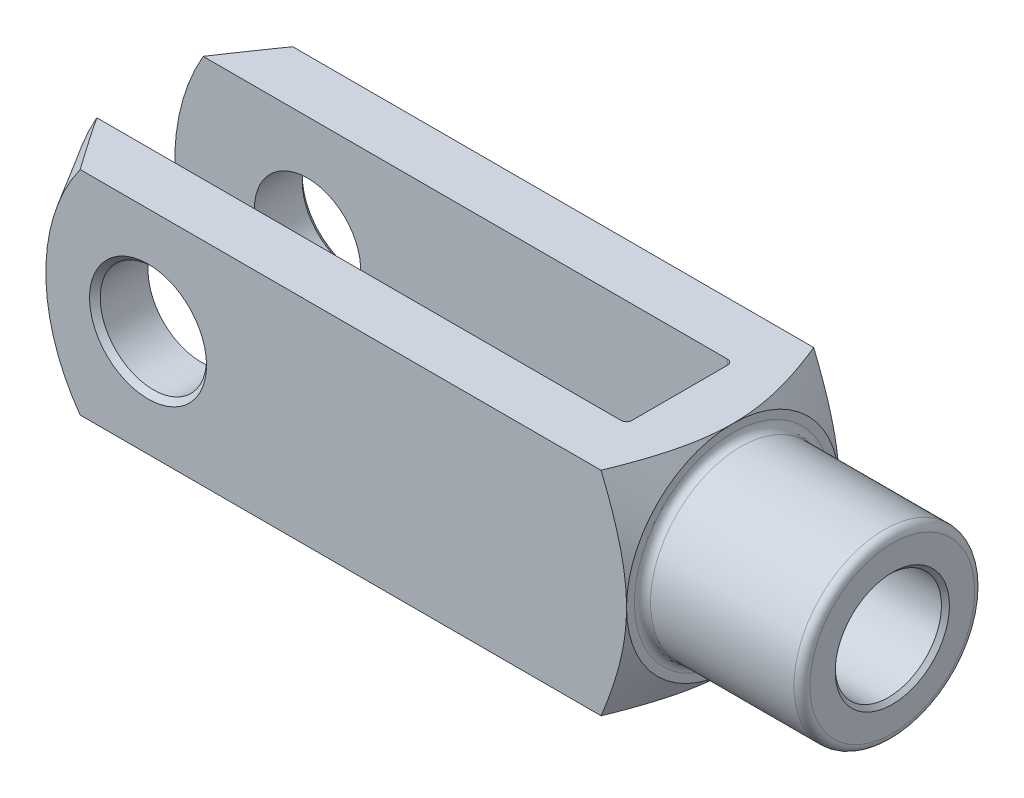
ISO-10303-21;
HEADER;
FILE_DESCRIPTION(('STEP AP214'),'2;1');
FILE_NAME('part.step','',(''),(''),'','','');
FILE_SCHEMA(('AUTOMOTIVE_DESIGN { 1 0 10303 214 1 1 1 1 }'));
ENDSEC;
DATA;
#1=APPLICATION_CONTEXT('core data for automotive mechanical design processes');
#2=APPLICATION_PROTOCOL_DEFINITION('international standard','automotive_design',2000,#1);
#3=PRODUCT_CONTEXT('',#1,'mechanical');
#4=PRODUCT('Part','Part','',(#3));
#5=PRODUCT_RELATED_PRODUCT_CATEGORY('part','',(#4));
#6=PRODUCT_DEFINITION_FORMATION('','',#4);
#7=PRODUCT_DEFINITION_CONTEXT('part definition',#1,'design');
#8=PRODUCT_DEFINITION('design','',#6,#7);
#9=PRODUCT_DEFINITION_SHAPE('','',#8);
#10=(LENGTH_UNIT() NAMED_UNIT(*) SI_UNIT(.MILLI.,.METRE.));
#11=(NAMED_UNIT(*) PLANE_ANGLE_UNIT() SI_UNIT($,.RADIAN.));
#12=(NAMED_UNIT(*) SI_UNIT($,.STERADIAN.) SOLID_ANGLE_UNIT());
#13=UNCERTAINTY_MEASURE_WITH_UNIT(LENGTH_MEASURE(1.E-05),#10,'distance_accuracy_value','');
#14=(GEOMETRIC_REPRESENTATION_CONTEXT(3) GLOBAL_UNCERTAINTY_ASSIGNED_CONTEXT((#13)) GLOBAL_UNIT_ASSIGNED_CONTEXT((#10,
#11,#12)) REPRESENTATION_CONTEXT('',''));
#15=CARTESIAN_POINT('',(0.,0.,0.));
#16=DIRECTION('',(0.,0.,1.));
#17=DIRECTION('',(1.,0.,0.));
#18=AXIS2_PLACEMENT_3D('',#15,#16,#17);
#19=CARTESIAN_POINT('',(-41.,-20.,-8.99999999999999));
#20=DIRECTION('',(0.,-1.,0.));
#21=DIRECTION('',(0.,0.,-1.));
#22=AXIS2_PLACEMENT_3D('',#19,#20,#21);
#23=CYLINDRICAL_SURFACE('',#22,1.);
#24=DIRECTION('',(0.,1.,0.));
#25=VECTOR('',#24,1.);
#26=CARTESIAN_POINT('',(-40.,-20.,-8.99999999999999));
#27=LINE('',#26,#25);
#28=CARTESIAN_POINT('',(-40.,-4.3588989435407,-8.99999999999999));
#29=VERTEX_POINT('',#28);
#30=CARTESIAN_POINT('',(-40.,-20.,-8.99999999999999));
#31=VERTEX_POINT('',#30);
#32=EDGE_CURVE('E359',#29,#31,#27,.F.);
#33=ORIENTED_EDGE('',*,*,#32,.F.);
#34=CARTESIAN_POINT('',(-40.,-4.3588989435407,-8.99999999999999));
#35=CARTESIAN_POINT('',(-40.0000151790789,-4.28657646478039,-9.03502940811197));
#36=CARTESIAN_POINT('',(-40.0018397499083,-4.2138483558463,-9.06917502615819));
#37=CARTESIAN_POINT('',(-40.0086750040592,-4.06774424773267,-9.13563818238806));
#38=CARTESIAN_POINT('',(-40.0136843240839,-3.99436853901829,-9.1679564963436));
#39=CARTESIAN_POINT('',(-40.0264446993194,-3.84721416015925,-9.2306733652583));
#40=CARTESIAN_POINT('',(-40.0341903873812,-3.77343655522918,-9.26107554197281));
#41=CARTESIAN_POINT('',(-40.0520865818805,-3.62542416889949,-9.32001323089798));
#42=CARTESIAN_POINT('',(-40.0622373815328,-3.551189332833,-9.34854851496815));
#43=CARTESIAN_POINT('',(-40.0957491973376,-3.32854256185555,-9.43110737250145));
#44=CARTESIAN_POINT('',(-40.1222296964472,-3.17955672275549,-9.4823526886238));
#45=CARTESIAN_POINT('',(-40.1816529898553,-2.88046339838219,-9.57745203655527));
#46=CARTESIAN_POINT('',(-40.2145999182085,-2.73035525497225,-9.6213013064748));
#47=CARTESIAN_POINT('',(-40.2998777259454,-2.36825595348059,-9.71798906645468));
#48=CARTESIAN_POINT('',(-40.3546487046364,-2.15587492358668,-9.76725305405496));
#49=CARTESIAN_POINT('',(-40.4708728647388,-1.73020697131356,-9.85157380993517));
#50=CARTESIAN_POINT('',(-40.5323270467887,-1.51691991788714,-9.88662844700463));
#51=CARTESIAN_POINT('',(-40.7230029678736,-0.876019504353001,-9.97086857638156));
#52=CARTESIAN_POINT('',(-40.8585728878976,-0.447232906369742,-9.99916563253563));
#53=CARTESIAN_POINT('',(-40.9959799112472,-0.012712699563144,-9.99999393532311));
#54=CARTESIAN_POINT('',(-40.9979899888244,-0.00635627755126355,-9.9999999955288));
#55=CARTESIAN_POINT('',(-41.,0.,-9.99999999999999));
#56=B_SPLINE_CURVE_WITH_KNOTS('',3,(#34,#35,#36,#37,#38,#39,#40,#41,#42,#43,#44,#45,#46,#47,#48,
#49,#50,#51,#52,#53,#54,#55),.UNSPECIFIED.,.F.,.F.,(4,2,2,2,2,2,2,2,2,2,4),(0.,0.24102239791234,
0.481941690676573,0.722391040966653,0.962869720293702,1.44176483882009,1.9209671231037,
2.59465687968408,3.26844764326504,4.61560355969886,4.63560356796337),.UNSPECIFIED.);
#57=CARTESIAN_POINT('',(-41.,0.,-9.99999999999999));
#58=VERTEX_POINT('',#57);
#59=EDGE_CURVE('E390',#29,#58,#56,.T.);
#60=ORIENTED_EDGE('',*,*,#59,.T.);
#61=DIRECTION('',(0.,1.,0.));
#62=VECTOR('',#61,1.);
#63=CARTESIAN_POINT('',(-41.,20.,-9.99999999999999));
#64=LINE('',#63,#62);
#65=CARTESIAN_POINT('',(-41.,-20.,-9.99999999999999));
#66=VERTEX_POINT('',#65);
#67=EDGE_CURVE('E183',#66,#58,#64,.T.);
#68=ORIENTED_EDGE('',*,*,#67,.F.);
#69=CARTESIAN_POINT('',(-41.,-20.,-8.99999999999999));
#70=DIRECTION('',(0.,-1.,0.));
#71=DIRECTION('',(0.,0.,-1.));
#72=AXIS2_PLACEMENT_3D('',#69,#70,#71);
#73=CIRCLE('',#72,1.);
#74=EDGE_CURVE('E198',#31,#66,#73,.F.);
#75=ORIENTED_EDGE('',*,*,#74,.F.);
#76=EDGE_LOOP('',(#33,#60,#68,#75));
#77=FACE_BOUND('',#76,.T.);
#78=ADVANCED_FACE('F37',(#77),#23,.F.);
#79=CARTESIAN_POINT('',(-40.,-20.,-9.99999999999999));
#80=DIRECTION('',(1.,0.,0.));
#81=DIRECTION('',(0.,0.,-1.));
#82=AXIS2_PLACEMENT_3D('',#79,#80,#81);
#83=PLANE('',#82);
#84=CARTESIAN_POINT('',(-40.,20.,-8.99999999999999));
#85=VERTEX_POINT('',#84);
#86=CARTESIAN_POINT('',(-40.,4.3588989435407,-8.99999999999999));
#87=VERTEX_POINT('',#86);
#88=EDGE_CURVE('E374',#85,#87,#27,.F.);
#89=ORIENTED_EDGE('',*,*,#88,.T.);
#90=CARTESIAN_POINT('',(-40.,0.,0.));
#91=DIRECTION('',(1.,0.,0.));
#92=DIRECTION('',(0.,0.,-1.));
#93=AXIS2_PLACEMENT_3D('',#90,#91,#92);
#94=CIRCLE('',#93,10.);
#95=CARTESIAN_POINT('',(-40.,4.35889894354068,9.));
#96=VERTEX_POINT('',#95);
#97=EDGE_CURVE('E414',#87,#96,#94,.T.);
#98=ORIENTED_EDGE('',*,*,#97,.T.);
#99=DIRECTION('',(0.,1.,0.));
#100=VECTOR('',#99,1.);
#101=CARTESIAN_POINT('',(-40.,20.,9.));
#102=LINE('',#101,#100);
#103=CARTESIAN_POINT('',(-40.,20.,9.));
#104=VERTEX_POINT('',#103);
#105=EDGE_CURVE('E160',#96,#104,#102,.T.);
#106=ORIENTED_EDGE('',*,*,#105,.T.);
#107=DIRECTION('',(0.,0.,-1.));
#108=VECTOR('',#107,1.);
#109=CARTESIAN_POINT('',(-40.,20.,-9.99999999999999));
#110=LINE('',#109,#108);
#111=EDGE_CURVE('E339',#104,#85,#110,.T.);
#112=ORIENTED_EDGE('',*,*,#111,.T.);
#113=EDGE_LOOP('',(#89,#98,#106,#112));
#114=FACE_BOUND('',#113,.T.);
#115=ADVANCED_FACE('F473',(#114),#83,.F.);
#116=CARTESIAN_POINT('',(-41.,-20.,9.));
#117=DIRECTION('',(0.,-1.,0.));
#118=DIRECTION('',(0.,0.,-1.));
#119=AXIS2_PLACEMENT_3D('',#116,#117,#118);
#120=CYLINDRICAL_SURFACE('',#119,1.);
#121=ORIENTED_EDGE('',*,*,#105,.F.);
#122=CARTESIAN_POINT('',(-40.,4.35889894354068,9.));
#123=CARTESIAN_POINT('',(-40.0000151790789,4.28657646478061,9.03502940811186));
#124=CARTESIAN_POINT('',(-40.0018397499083,4.21384835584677,9.06917502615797));
#125=CARTESIAN_POINT('',(-40.0086750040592,4.06774424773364,9.13563818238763));
#126=CARTESIAN_POINT('',(-40.0136843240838,3.99436853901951,9.16795649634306));
#127=CARTESIAN_POINT('',(-40.0264446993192,3.84721416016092,9.2306733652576));
#128=CARTESIAN_POINT('',(-40.034190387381,3.77343655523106,9.26107554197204));
#129=CARTESIAN_POINT('',(-40.0520865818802,3.62542416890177,9.32001323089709));
#130=CARTESIAN_POINT('',(-40.0622373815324,3.55118933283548,9.3485485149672));
#131=CARTESIAN_POINT('',(-40.0957491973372,3.32854256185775,9.43110737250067));
#132=CARTESIAN_POINT('',(-40.1222296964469,3.17955672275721,9.48235268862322));
#133=CARTESIAN_POINT('',(-40.1816529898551,2.88046339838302,9.57745203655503));
#134=CARTESIAN_POINT('',(-40.2145999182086,2.73035525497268,9.6213013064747));
#135=CARTESIAN_POINT('',(-40.2998777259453,2.36825595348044,9.71798906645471));
#136=CARTESIAN_POINT('',(-40.3546487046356,2.15587492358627,9.76725305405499));
#137=CARTESIAN_POINT('',(-40.4708728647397,1.73020697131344,9.85157380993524));
#138=CARTESIAN_POINT('',(-40.5323270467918,1.51691991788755,9.88662844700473));
#139=CARTESIAN_POINT('',(-40.7230029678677,0.876019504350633,9.97086857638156));
#140=CARTESIAN_POINT('',(-40.8585728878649,0.44723290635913,9.99916563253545));
#141=CARTESIAN_POINT('',(-40.9959799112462,0.0127126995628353,9.99999393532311));
#142=CARTESIAN_POINT('',(-40.9979899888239,0.00635627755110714,9.99999999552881));
#143=CARTESIAN_POINT('',(-41.,0.,10.));
#144=B_SPLINE_CURVE_WITH_KNOTS('',3,(#122,#123,#124,#125,#126,#127,#128,#129,#130,#131,#132,
#133,#134,#135,#136,#137,#138,#139,#140,#141,#142,#143),.UNSPECIFIED.,.F.,.F.,(4,2,2,2,2,2,2,2,
2,2,4),(0.,0.241022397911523,0.481941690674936,0.722391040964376,0.962869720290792,
1.44176483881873,1.92096712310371,2.59465687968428,3.26844764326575,4.61560355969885,
4.63560356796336),.UNSPECIFIED.);
#145=CARTESIAN_POINT('',(-41.,0.,10.));
#146=VERTEX_POINT('',#145);
#147=EDGE_CURVE('E145',#96,#146,#144,.T.);
#148=ORIENTED_EDGE('',*,*,#147,.T.);
#149=DIRECTION('',(0.,1.,0.));
#150=VECTOR('',#149,1.);
#151=CARTESIAN_POINT('',(-41.,-20.,10.));
#152=LINE('',#151,#150);
#153=CARTESIAN_POINT('',(-41.,20.,10.));
#154=VERTEX_POINT('',#153);
#155=EDGE_CURVE('E159',#154,#146,#152,.F.);
#156=ORIENTED_EDGE('',*,*,#155,.F.);
#157=CARTESIAN_POINT('',(-41.,20.,9.));
#158=DIRECTION('',(0.,1.,0.));
#159=DIRECTION('',(0.,0.,1.));
#160=AXIS2_PLACEMENT_3D('',#157,#158,#159);
#161=CIRCLE('',#160,1.);
#162=EDGE_CURVE('E190',#104,#154,#161,.F.);
#163=ORIENTED_EDGE('',*,*,#162,.F.);
#164=EDGE_LOOP('',(#121,#148,#156,#163));
#165=FACE_BOUND('',#164,.T.);
#166=ADVANCED_FACE('F156',(#165),#120,.F.);
#167=CARTESIAN_POINT('',(-145.,-20.,-9.99999999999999));
#168=DIRECTION('',(0.,0.,-1.));
#169=DIRECTION('',(-1.,0.,0.));
#170=AXIS2_PLACEMENT_3D('',#167,#168,#169);
#171=PLANE('',#170);
#172=CARTESIAN_POINT('',(-120.,0.,-9.99999999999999));
#173=DIRECTION('',(0.,0.,-1.));
#174=DIRECTION('',(-1.,0.,0.));
#175=AXIS2_PLACEMENT_3D('',#172,#173,#174);
#176=CIRCLE('',#175,9.99999999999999);
#177=CARTESIAN_POINT('',(-130.,0.,-9.99999999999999));
#178=VERTEX_POINT('',#177);
#179=EDGE_CURVE('E368',#178,#178,#176,.F.);
#180=ORIENTED_EDGE('',*,*,#179,.F.);
#181=EDGE_LOOP('',(#180));
#182=FACE_BOUND('',#181,.T.);
#183=CARTESIAN_POINT('',(-105.,0.,-9.99999999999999));
#184=DIRECTION('',(0.,0.,1.));
#185=DIRECTION('',(1.,0.,0.));
#186=AXIS2_PLACEMENT_3D('',#183,#184,#185);
#187=CIRCLE('',#186,40.);
#188=CARTESIAN_POINT('',(-139.641016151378,20.,-9.99999999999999));
#189=VERTEX_POINT('',#188);
#190=CARTESIAN_POINT('',(-139.641016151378,-20.,-9.99999999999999));
#191=VERTEX_POINT('',#190);
#192=EDGE_CURVE('E277',#189,#191,#187,.T.);
#193=ORIENTED_EDGE('',*,*,#192,.T.);
#194=DIRECTION('',(-1.,0.,0.));
#195=VECTOR('',#194,1.);
#196=CARTESIAN_POINT('',(-145.,-20.,-9.99999999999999));
#197=LINE('',#196,#195);
#198=EDGE_CURVE('E334',#66,#191,#197,.T.);
#199=ORIENTED_EDGE('',*,*,#198,.F.);
#200=ORIENTED_EDGE('',*,*,#67,.T.);
#201=CARTESIAN_POINT('',(-41.,20.,-9.99999999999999));
#202=VERTEX_POINT('',#201);
#203=EDGE_CURVE('E179',#58,#202,#64,.T.);
#204=ORIENTED_EDGE('',*,*,#203,.T.);
#205=DIRECTION('',(-1.,0.,0.));
#206=VECTOR('',#205,1.);
#207=CARTESIAN_POINT('',(-145.,20.,-9.99999999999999));
#208=LINE('',#207,#206);
#209=EDGE_CURVE('E347',#202,#189,#208,.T.);
#210=ORIENTED_EDGE('',*,*,#209,.T.);
#211=EDGE_LOOP('',(#193,#199,#200,#204,#210));
#212=FACE_BOUND('',#211,.T.);
#213=ADVANCED_FACE('F393',(#182,#212),#171,.F.);
#214=CARTESIAN_POINT('',(-145.,-20.,10.));
#215=DIRECTION('',(0.,0.,1.));
#216=DIRECTION('',(1.,0.,0.));
#217=AXIS2_PLACEMENT_3D('',#214,#215,#216);
#218=PLANE('',#217);
#219=CARTESIAN_POINT('',(-120.,0.,10.));
#220=DIRECTION('',(0.,0.,1.));
#221=DIRECTION('',(1.,0.,0.));
#222=AXIS2_PLACEMENT_3D('',#219,#220,#221);
#223=CIRCLE('',#222,9.99999999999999);
#224=CARTESIAN_POINT('',(-110.,0.,10.));
#225=VERTEX_POINT('',#224);
#226=EDGE_CURVE('E346',#225,#225,#223,.F.);
#227=ORIENTED_EDGE('',*,*,#226,.F.);
#228=EDGE_LOOP('',(#227));
#229=FACE_BOUND('',#228,.T.);
#230=DIRECTION('',(1.,0.,0.));
#231=VECTOR('',#230,1.);
#232=CARTESIAN_POINT('',(-145.,-20.,10.));
#233=LINE('',#232,#231);
#234=CARTESIAN_POINT('',(-139.641016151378,-20.,10.));
#235=VERTEX_POINT('',#234);
#236=CARTESIAN_POINT('',(-41.,-20.,10.));
#237=VERTEX_POINT('',#236);
#238=EDGE_CURVE('E338',#235,#237,#233,.T.);
#239=ORIENTED_EDGE('',*,*,#238,.F.);
#240=CARTESIAN_POINT('',(-105.,0.,10.));
#241=DIRECTION('',(0.,0.,1.));
#242=DIRECTION('',(1.,0.,0.));
#243=AXIS2_PLACEMENT_3D('',#240,#241,#242);
#244=CIRCLE('',#243,40.);
#245=CARTESIAN_POINT('',(-139.641016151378,20.,10.));
#246=VERTEX_POINT('',#245);
#247=EDGE_CURVE('E430',#246,#235,#244,.T.);
#248=ORIENTED_EDGE('',*,*,#247,.F.);
#249=DIRECTION('',(1.,0.,0.));
#250=VECTOR('',#249,1.);
#251=CARTESIAN_POINT('',(-145.,20.,10.));
#252=LINE('',#251,#250);
#253=EDGE_CURVE('E176',#246,#154,#252,.T.);
#254=ORIENTED_EDGE('',*,*,#253,.T.);
#255=ORIENTED_EDGE('',*,*,#155,.T.);
#256=EDGE_CURVE('E164',#146,#237,#152,.F.);
#257=ORIENTED_EDGE('',*,*,#256,.T.);
#258=EDGE_LOOP('',(#239,#248,#254,#255,#257));
#259=FACE_BOUND('',#258,.T.);
#260=ADVANCED_FACE('F173',(#229,#259),#218,.F.);
#261=CARTESIAN_POINT('',(-145.,-20.,20.));
#262=DIRECTION('',(0.,0.,1.));
#263=DIRECTION('',(1.,0.,0.));
#264=AXIS2_PLACEMENT_3D('',#261,#262,#263);
#265=PLANE('',#264);
#266=CARTESIAN_POINT('',(-120.,0.,20.));
#267=DIRECTION('',(0.,0.,1.));
#268=DIRECTION('',(1.,0.,0.));
#269=AXIS2_PLACEMENT_3D('',#266,#267,#268);
#270=CIRCLE('',#269,11.);
#271=CARTESIAN_POINT('',(-109.,0.,20.));
#272=VERTEX_POINT('',#271);
#273=EDGE_CURVE('E229',#272,#272,#270,.F.);
#274=ORIENTED_EDGE('',*,*,#273,.T.);
#275=EDGE_LOOP('',(#274));
#276=FACE_BOUND('',#275,.T.);
#277=DIRECTION('',(1.,0.,0.));
#278=VECTOR('',#277,1.);
#279=CARTESIAN_POINT('',(-145.,20.,20.));
#280=LINE('',#279,#278);
#281=CARTESIAN_POINT('',(-132.775044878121,20.,20.));
#282=VERTEX_POINT('',#281);
#283=CARTESIAN_POINT('',(-34.7829262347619,20.,20.));
#284=VERTEX_POINT('',#283);
#285=EDGE_CURVE('E366',#282,#284,#280,.T.);
#286=ORIENTED_EDGE('',*,*,#285,.F.);
#287=CARTESIAN_POINT('',(-105.,0.,20.));
#288=DIRECTION('',(0.,0.,1.));
#289=DIRECTION('',(1.,0.,0.));
#290=AXIS2_PLACEMENT_3D('',#287,#288,#289);
#291=CIRCLE('',#290,34.2264973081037);
#292=CARTESIAN_POINT('',(-132.775044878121,-20.,20.));
#293=VERTEX_POINT('',#292);
#294=EDGE_CURVE('E61',#282,#293,#291,.T.);
#295=ORIENTED_EDGE('',*,*,#294,.T.);
#296=DIRECTION('',(1.,0.,0.));
#297=VECTOR('',#296,1.);
#298=CARTESIAN_POINT('',(-145.,-20.,20.));
#299=LINE('',#298,#297);
#300=CARTESIAN_POINT('',(-34.7829262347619,-20.,20.));
#301=VERTEX_POINT('',#300);
#302=EDGE_CURVE('E363',#293,#301,#299,.T.);
#303=ORIENTED_EDGE('',*,*,#302,.T.);
#304=CARTESIAN_POINT('',(-44.7117469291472,-40.8480870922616,20.));
#305=CARTESIAN_POINT('',(-44.4561917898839,-40.3552393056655,20.));
#306=CARTESIAN_POINT('',(-44.2013369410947,-39.8620284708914,20.));
#307=CARTESIAN_POINT('',(-43.693177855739,-38.874806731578,20.));
#308=CARTESIAN_POINT('',(-43.4398736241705,-38.3807958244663,20.));
#309=CARTESIAN_POINT('',(-42.6824888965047,-36.8974069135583,20.));
#310=CARTESIAN_POINT('',(-42.1809621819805,-35.9067224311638,20.));
#311=CARTESIAN_POINT('',(-41.18538005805,-33.9194417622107,20.));
#312=CARTESIAN_POINT('',(-40.6913391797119,-32.9228382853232,20.));
#313=CARTESIAN_POINT('',(-39.7136550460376,-30.9245603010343,20.));
#314=CARTESIAN_POINT('',(-39.2300116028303,-29.9228858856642,20.));
#315=CARTESIAN_POINT('',(-38.2464042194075,-27.8515018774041,20.));
#316=CARTESIAN_POINT('',(-37.7472668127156,-26.7813979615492,20.));
#317=CARTESIAN_POINT('',(-37.0128527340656,-25.1696896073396,20.));
#318=CARTESIAN_POINT('',(-36.7704219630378,-24.6313428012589,20.));
#319=CARTESIAN_POINT('',(-36.2910428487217,-23.5522150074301,20.));
#320=CARTESIAN_POINT('',(-36.0540944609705,-23.0114340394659,20.));
#321=CARTESIAN_POINT('',(-35.5865923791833,-21.9273871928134,20.));
#322=CARTESIAN_POINT('',(-35.356035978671,-21.3841224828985,20.));
#323=CARTESIAN_POINT('',(-34.9021820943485,-20.2945711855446,20.));
#324=CARTESIAN_POINT('',(-34.6788845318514,-19.748284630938,20.));
#325=CARTESIAN_POINT('',(-34.2407069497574,-18.6523948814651,20.));
#326=CARTESIAN_POINT('',(-34.0258261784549,-18.1027919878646,20.));
#327=CARTESIAN_POINT('',(-33.6058159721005,-16.999875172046,20.));
#328=CARTESIAN_POINT('',(-33.4006864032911,-16.4465613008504,20.));
#329=CARTESIAN_POINT('',(-32.9584948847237,-15.2154115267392,20.));
#330=CARTESIAN_POINT('',(-32.724154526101,-14.5365922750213,20.));
#331=CARTESIAN_POINT('',(-32.2756396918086,-13.1723527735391,20.));
#332=CARTESIAN_POINT('',(-32.061463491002,-12.4869330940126,20.));
#333=CARTESIAN_POINT('',(-31.6572524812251,-11.1089764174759,20.));
#334=CARTESIAN_POINT('',(-31.4672171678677,-10.4164395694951,20.));
#335=CARTESIAN_POINT('',(-31.115826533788,-9.02406913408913,20.));
#336=CARTESIAN_POINT('',(-30.9544708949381,-8.32423562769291,20.));
#337=CARTESIAN_POINT('',(-30.6686985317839,-6.93411418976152,20.));
#338=CARTESIAN_POINT('',(-30.543503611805,-6.24398781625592,20.));
#339=CARTESIAN_POINT('',(-30.329515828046,-4.85806653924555,20.));
#340=CARTESIAN_POINT('',(-30.2407217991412,-4.16227181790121,20.));
#341=CARTESIAN_POINT('',(-30.1032474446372,-2.76713808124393,20.));
#342=CARTESIAN_POINT('',(-30.0545409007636,-2.06780168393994,20.));
#343=CARTESIAN_POINT('',(-29.9993902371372,-0.667457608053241,20.));
#344=CARTESIAN_POINT('',(-29.9929446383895,0.0335500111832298,20.));
#345=CARTESIAN_POINT('',(-30.0215257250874,1.38358015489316,20.));
#346=CARTESIAN_POINT('',(-30.053564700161,2.03266864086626,20.));
#347=CARTESIAN_POINT('',(-30.1529107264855,3.32811214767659,20.));
#348=CARTESIAN_POINT('',(-30.2202176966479,3.97446717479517,20.));
#349=CARTESIAN_POINT('',(-30.3876322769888,5.26320613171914,20.));
#350=CARTESIAN_POINT('',(-30.4877568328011,5.90558783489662,20.));
#351=CARTESIAN_POINT('',(-30.7175054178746,7.18501977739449,20.));
#352=CARTESIAN_POINT('',(-30.8471302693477,7.82206986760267,20.));
#353=CARTESIAN_POINT('',(-31.1364002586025,9.10865741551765,20.));
#354=CARTESIAN_POINT('',(-31.2968057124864,9.75802261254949,20.));
#355=CARTESIAN_POINT('',(-31.6411635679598,11.0504361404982,20.));
#356=CARTESIAN_POINT('',(-31.8251161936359,11.6934844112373,20.));
#357=CARTESIAN_POINT('',(-32.2130089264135,12.9734650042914,20.));
#358=CARTESIAN_POINT('',(-32.4169481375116,13.6103975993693,20.));
#359=CARTESIAN_POINT('',(-32.7355110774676,14.5615046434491,20.));
#360=CARTESIAN_POINT('',(-32.8438059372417,14.8778200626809,20.));
#361=CARTESIAN_POINT('',(-33.0642784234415,15.5090943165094,20.));
#362=CARTESIAN_POINT('',(-33.1764560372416,15.8240531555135,20.));
#363=CARTESIAN_POINT('',(-33.5368964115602,16.8182188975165,20.));
#364=CARTESIAN_POINT('',(-33.7917035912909,17.4950585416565,20.));
#365=CARTESIAN_POINT('',(-34.315152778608,18.8433829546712,20.));
#366=CARTESIAN_POINT('',(-34.5837956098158,19.5148674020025,20.));
#367=CARTESIAN_POINT('',(-35.1326821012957,20.8532445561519,20.));
#368=CARTESIAN_POINT('',(-35.412928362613,21.5201361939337,20.));
#369=CARTESIAN_POINT('',(-35.9830913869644,22.8497479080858,20.));
#370=CARTESIAN_POINT('',(-36.2730079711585,23.5124680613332,20.));
#371=CARTESIAN_POINT('',(-36.86125118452,24.8348444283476,20.));
#372=CARTESIAN_POINT('',(-37.1595848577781,25.4944975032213,20.));
#373=CARTESIAN_POINT('',(-37.7631804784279,26.8106245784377,20.));
#374=CARTESIAN_POINT('',(-38.0684424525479,27.4670985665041,20.));
#375=CARTESIAN_POINT('',(-38.6848375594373,28.7771877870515,20.));
#376=CARTESIAN_POINT('',(-38.9959700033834,29.4308033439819,20.));
#377=CARTESIAN_POINT('',(-39.6233091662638,30.735596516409,20.));
#378=CARTESIAN_POINT('',(-39.9395159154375,31.3867741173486,20.));
#379=CARTESIAN_POINT('',(-40.896609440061,33.3410563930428,20.));
#380=CARTESIAN_POINT('',(-41.5440877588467,34.6409339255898,20.));
#381=CARTESIAN_POINT('',(-42.8522843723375,37.234022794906,20.));
#382=CARTESIAN_POINT('',(-43.5130029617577,38.5272339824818,20.));
#383=CARTESIAN_POINT('',(-44.8443480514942,41.1077325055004,20.));
#384=CARTESIAN_POINT('',(-45.5149695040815,42.3950224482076,20.));
#385=CARTESIAN_POINT('',(-46.8642487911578,44.9653657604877,20.));
#386=CARTESIAN_POINT('',(-47.5429065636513,46.2484191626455,20.));
#387=CARTESIAN_POINT('',(-48.8053932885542,48.6208089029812,20.));
#388=CARTESIAN_POINT('',(-49.3883375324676,49.7106165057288,20.));
#389=CARTESIAN_POINT('',(-50.5581313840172,51.8881346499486,20.));
#390=CARTESIAN_POINT('',(-51.1449809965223,52.9758451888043,20.));
#391=CARTESIAN_POINT('',(-52.3220562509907,55.1496344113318,20.));
#392=CARTESIAN_POINT('',(-52.9122823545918,56.2357128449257,20.));
#393=CARTESIAN_POINT('',(-54.0955388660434,58.4063411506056,20.));
#394=CARTESIAN_POINT('',(-54.6885692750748,59.4908910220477,20.));
#395=CARTESIAN_POINT('',(-55.8736310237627,61.6524632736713,20.));
#396=CARTESIAN_POINT('',(-56.4656486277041,62.7294931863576,20.));
#397=CARTESIAN_POINT('',(-57.651739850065,64.8824205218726,20.));
#398=CARTESIAN_POINT('',(-58.2458134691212,65.9583179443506,20.));
#399=CARTESIAN_POINT('',(-59.4356534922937,68.1089540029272,20.));
#400=CARTESIAN_POINT('',(-60.0314196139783,69.1836927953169,20.));
#401=CARTESIAN_POINT('',(-61.2245219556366,71.3322969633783,20.));
#402=CARTESIAN_POINT('',(-61.8218581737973,72.4061623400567,20.));
#403=CARTESIAN_POINT('',(-62.4198720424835,73.4796497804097,20.));
#404=B_SPLINE_CURVE_WITH_KNOTS('',3,(#304,#305,#306,#307,#308,#309,#310,#311,#312,#313,#314,
#315,#316,#317,#318,#319,#320,#321,#322,#323,#324,#325,#326,#327,#328,#329,#330,#331,#332,#333,
#334,#335,#336,#337,#338,#339,#340,#341,#342,#343,#344,#345,#346,#347,#348,#349,#350,#351,#352,
#353,#354,#355,#356,#357,#358,#359,#360,#361,#362,#363,#364,#365,#366,#367,#368,#369,#370,#371,
#372,#373,#374,#375,#376,#377,#378,#379,#380,#381,#382,#383,#384,#385,#386,#387,#388,#389,#390,
#391,#392,#393,#394,#395,#396,#397,#398,#399,#400,#401,#402,#403),.UNSPECIFIED.,.F.,.F.,(4,2,2,
2,2,2,2,2,2,2,2,2,2,2,2,2,2,2,2,2,2,2,2,2,2,2,2,2,2,2,2,2,2,2,2,2,2,2,2,2,2,2,2,2,2,2,2,2,2,4),
(0.,1.66549183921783,3.33098904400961,6.66215149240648,9.9991147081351,13.3360175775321,
16.8782159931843,18.6494369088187,20.4206434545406,22.1910882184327,23.961513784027,
25.7317808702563,27.5020236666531,29.6561476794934,31.8100872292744,33.9639817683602,
36.117852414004,38.2211628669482,40.3244059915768,42.4262724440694,44.5280653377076,
46.4767082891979,48.4253467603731,50.3749930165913,52.324693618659,54.3308265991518,
56.3369786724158,58.3430408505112,59.346040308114,60.3490365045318,62.5184742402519,
64.6880412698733,66.8580972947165,69.0281132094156,71.2000024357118,73.3719000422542,
75.5435443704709,77.7152016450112,82.0717130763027,86.4283215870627,90.7827812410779,
95.1372073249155,98.8449661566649,102.552729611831,106.261012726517,109.969297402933,
113.656340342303,117.343384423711,121.02984567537,124.716302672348),.UNSPECIFIED.);
#405=CARTESIAN_POINT('',(-30.,0.,20.));
#406=VERTEX_POINT('',#405);
#407=EDGE_CURVE('E306',#406,#301,#404,.F.);
#408=ORIENTED_EDGE('',*,*,#407,.F.);
#409=EDGE_CURVE('E304',#284,#406,#404,.F.);
#410=ORIENTED_EDGE('',*,*,#409,.F.);
#411=EDGE_LOOP('',(#286,#295,#303,#408,#410));
#412=FACE_BOUND('',#411,.T.);
#413=ADVANCED_FACE('F288',(#276,#412),#265,.T.);
#414=CARTESIAN_POINT('',(-145.,-20.,20.));
#415=DIRECTION('',(0.,-1.,0.));
#416=DIRECTION('',(0.,0.,-1.));
#417=AXIS2_PLACEMENT_3D('',#414,#415,#416);
#418=PLANE('',#417);
#419=ORIENTED_EDGE('',*,*,#198,.T.);
#420=CARTESIAN_POINT('',(-155.464255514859,-20.,14.7388337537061));
#421=CARTESIAN_POINT('',(-154.977726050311,-20.,13.9554262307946));
#422=CARTESIAN_POINT('',(-154.490511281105,-20.,13.1724443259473));
#423=CARTESIAN_POINT('',(-153.514581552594,-20.,11.6074156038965));
#424=CARTESIAN_POINT('',(-153.025866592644,-20.,10.8253687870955));
#425=CARTESIAN_POINT('',(-151.557258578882,-20.,8.48072725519));
#426=CARTESIAN_POINT('',(-150.574921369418,-20.,6.9196620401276));
#427=CARTESIAN_POINT('',(-148.601276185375,-20.,3.80059817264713));
#428=CARTESIAN_POINT('',(-147.609958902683,-20.,2.24260540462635));
#429=CARTESIAN_POINT('',(-146.115876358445,-20.,-0.0898192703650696));
#430=CARTESIAN_POINT('',(-145.616667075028,-20.,-0.866529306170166));
#431=CARTESIAN_POINT('',(-144.615610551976,-20.,-2.41825426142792));
#432=CARTESIAN_POINT('',(-144.113763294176,-20.,-3.19326916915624));
#433=CARTESIAN_POINT('',(-142.561953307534,-20.,-5.57992347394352));
#434=CARTESIAN_POINT('',(-141.50712682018,-20.,-7.18841108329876));
#435=CARTESIAN_POINT('',(-139.912924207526,-20.,-9.59319983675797));
#436=CARTESIAN_POINT('',(-139.379531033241,-20.,-10.3934700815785));
#437=CARTESIAN_POINT('',(-138.308209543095,-20.,-11.9909680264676));
#438=CARTESIAN_POINT('',(-137.770281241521,-20.,-12.7881957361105));
#439=CARTESIAN_POINT('',(-136.689661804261,-20.,-14.3785600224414));
#440=CARTESIAN_POINT('',(-136.146974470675,-20.,-15.1716991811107));
#441=CARTESIAN_POINT('',(-135.055691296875,-20.,-16.753908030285));
#442=CARTESIAN_POINT('',(-134.507095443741,-20.,-17.5429777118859));
#443=CARTESIAN_POINT('',(-133.403112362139,-20.,-19.1163023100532));
#444=CARTESIAN_POINT('',(-132.847725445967,-20.,-19.9005574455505));
#445=CARTESIAN_POINT('',(-131.729030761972,-20.,-21.4633921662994));
#446=CARTESIAN_POINT('',(-131.165723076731,-20.,-22.241971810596));
#447=CARTESIAN_POINT('',(-130.035102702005,-20.,-23.7851048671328));
#448=CARTESIAN_POINT('',(-129.467876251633,-20.,-24.5497213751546));
#449=CARTESIAN_POINT('',(-128.322623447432,-20.,-26.0708599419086));
#450=CARTESIAN_POINT('',(-127.744596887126,-20.,-26.8273818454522));
#451=CARTESIAN_POINT('',(-126.574851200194,-20.,-28.3314583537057));
#452=CARTESIAN_POINT('',(-125.983114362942,-20.,-29.0789992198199));
#453=CARTESIAN_POINT('',(-124.784049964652,-20.,-30.5614329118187));
#454=CARTESIAN_POINT('',(-124.176723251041,-20.,-31.2963264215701));
#455=CARTESIAN_POINT('',(-122.949334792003,-20.,-32.74243725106));
#456=CARTESIAN_POINT('',(-122.329470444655,-20.,-33.4538210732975));
#457=CARTESIAN_POINT('',(-121.38219040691,-20.,-34.5053301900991));
#458=CARTESIAN_POINT('',(-121.063464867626,-20.,-34.8532924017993));
#459=CARTESIAN_POINT('',(-120.419506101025,-20.,-35.5431342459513));
#460=CARTESIAN_POINT('',(-120.094273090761,-20.,-35.8850140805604));
#461=CARTESIAN_POINT('',(-119.437235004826,-20.,-36.5609344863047));
#462=CARTESIAN_POINT('',(-119.105446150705,-20.,-36.8949907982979));
#463=CARTESIAN_POINT('',(-118.433672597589,-20.,-37.5548111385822));
#464=CARTESIAN_POINT('',(-118.093687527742,-20.,-37.8805747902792));
#465=CARTESIAN_POINT('',(-117.404695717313,-20.,-38.5220472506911));
#466=CARTESIAN_POINT('',(-117.05569413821,-20.,-38.8377615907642));
#467=CARTESIAN_POINT('',(-116.347353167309,-20.,-39.4573309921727));
#468=CARTESIAN_POINT('',(-115.988015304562,-20.,-39.7611877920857));
#469=CARTESIAN_POINT('',(-115.433764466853,-20.,-40.2114960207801));
#470=CARTESIAN_POINT('',(-115.24311186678,-20.,-40.3632010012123));
#471=CARTESIAN_POINT('',(-114.858487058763,-20.,-40.6623387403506));
#472=CARTESIAN_POINT('',(-114.664514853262,-20.,-40.8097715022));
#473=CARTESIAN_POINT('',(-114.077241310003,-20.,-41.245039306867));
#474=CARTESIAN_POINT('',(-113.678634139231,-20.,-41.5258020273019));
#475=CARTESIAN_POINT('',(-112.866141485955,-20.,-42.0636748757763));
#476=CARTESIAN_POINT('',(-112.452268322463,-20.,-42.3208035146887));
#477=CARTESIAN_POINT('',(-111.607700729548,-20.,-42.8058851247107));
#478=CARTESIAN_POINT('',(-111.177010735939,-20.,-43.0338457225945));
#479=CARTESIAN_POINT('',(-110.398559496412,-20.,-43.4056496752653));
#480=CARTESIAN_POINT('',(-110.054305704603,-20.,-43.5568168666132));
#481=CARTESIAN_POINT('',(-109.355718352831,-20.,-43.8338983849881));
#482=CARTESIAN_POINT('',(-109.001385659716,-20.,-43.9598148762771));
#483=CARTESIAN_POINT('',(-108.284109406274,-20.,-44.1824113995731));
#484=CARTESIAN_POINT('',(-107.921178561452,-20.,-44.2791320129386));
#485=CARTESIAN_POINT('',(-107.188106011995,-20.,-44.4400017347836));
#486=CARTESIAN_POINT('',(-106.817964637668,-20.,-44.5041523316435));
#487=CARTESIAN_POINT('',(-106.069490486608,-20.,-44.5976048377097));
#488=CARTESIAN_POINT('',(-105.691112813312,-20.,-44.6265519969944));
#489=CARTESIAN_POINT('',(-104.933349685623,-20.,-44.6470380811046));
#490=CARTESIAN_POINT('',(-104.553964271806,-20.,-44.6385784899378));
#491=CARTESIAN_POINT('',(-103.797786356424,-20.,-44.5846599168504));
#492=CARTESIAN_POINT('',(-103.420994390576,-20.,-44.5391935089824));
#493=CARTESIAN_POINT('',(-102.673309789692,-20.,-44.4133535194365));
#494=CARTESIAN_POINT('',(-102.302418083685,-20.,-44.3329744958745));
#495=CARTESIAN_POINT('',(-101.501082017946,-20.,-44.1227716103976));
#496=CARTESIAN_POINT('',(-101.072325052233,-20.,-43.9865486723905));
#497=CARTESIAN_POINT('',(-100.228715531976,-20.,-43.6760654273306));
#498=CARTESIAN_POINT('',(-99.813870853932,-20.,-43.5017839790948));
#499=CARTESIAN_POINT('',(-99.2021903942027,-20.,-43.2164310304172));
#500=CARTESIAN_POINT('',(-98.9997370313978,-20.,-43.1171417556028));
#501=CARTESIAN_POINT('',(-98.5986091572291,-20.,-42.9113932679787));
#502=CARTESIAN_POINT('',(-98.3999330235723,-20.,-42.8049372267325));
#503=CARTESIAN_POINT('',(-98.0062245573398,-20.,-42.5855142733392));
#504=CARTESIAN_POINT('',(-97.8111921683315,-20.,-42.4725474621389));
#505=CARTESIAN_POINT('',(-97.4246406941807,-20.,-42.2407087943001));
#506=CARTESIAN_POINT('',(-97.2331221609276,-20.,-42.1218360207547));
#507=CARTESIAN_POINT('',(-96.5392426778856,-20.,-41.6775875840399));
#508=CARTESIAN_POINT('',(-96.0471261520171,-20.,-41.3361114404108));
#509=CARTESIAN_POINT('',(-95.0840622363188,-20.,-40.6244535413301));
#510=CARTESIAN_POINT('',(-94.6131250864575,-20.,-40.2542581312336));
#511=CARTESIAN_POINT('',(-93.6888042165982,-20.,-39.4909076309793));
#512=CARTESIAN_POINT('',(-93.2354560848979,-20.,-39.0977096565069));
#513=CARTESIAN_POINT('',(-92.3447584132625,-20.,-38.2938363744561));
#514=CARTESIAN_POINT('',(-91.9074062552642,-20.,-37.8831639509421));
#515=CARTESIAN_POINT('',(-91.0434779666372,-20.,-37.0449994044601));
#516=CARTESIAN_POINT('',(-90.6169935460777,-20.,-36.6174131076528));
#517=CARTESIAN_POINT('',(-89.775913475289,-20.,-35.750712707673));
#518=CARTESIAN_POINT('',(-89.3613182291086,-20.,-35.3115982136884));
#519=CARTESIAN_POINT('',(-88.5428320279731,-20.,-34.4243699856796));
#520=CARTESIAN_POINT('',(-88.1389304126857,-20.,-33.9762660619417));
#521=CARTESIAN_POINT('',(-87.3400472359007,-20.,-33.0722099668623));
#522=CARTESIAN_POINT('',(-86.9450655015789,-20.,-32.6162579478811));
#523=CARTESIAN_POINT('',(-86.0007892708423,-20.,-31.5074230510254));
#524=CARTESIAN_POINT('',(-85.4553790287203,-20.,-30.8512338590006));
#525=CARTESIAN_POINT('',(-84.3773944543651,-20.,-29.5282176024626));
#526=CARTESIAN_POINT('',(-83.8448226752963,-20.,-28.8613884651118));
#527=CARTESIAN_POINT('',(-82.7986511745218,-20.,-27.5294654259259));
#528=CARTESIAN_POINT('',(-82.2848857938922,-20.,-26.8645014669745));
#529=CARTESIAN_POINT('',(-81.5210718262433,-20.,-25.8620207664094));
#530=CARTESIAN_POINT('',(-81.2676429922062,-20.,-25.5270710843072));
#531=CARTESIAN_POINT('',(-80.7628770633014,-20.,-24.8556040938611));
#532=CARTESIAN_POINT('',(-80.5115399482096,-20.,-24.519086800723));
#533=CARTESIAN_POINT('',(-80.2611662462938,-20.,-24.1818536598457));
#534=B_SPLINE_CURVE_WITH_KNOTS('',3,(#420,#421,#422,#423,#424,#425,#426,#427,#428,#429,#430,
#431,#432,#433,#434,#435,#436,#437,#438,#439,#440,#441,#442,#443,#444,#445,#446,#447,#448,#449,
#450,#451,#452,#453,#454,#455,#456,#457,#458,#459,#460,#461,#462,#463,#464,#465,#466,#467,#468,
#469,#470,#471,#472,#473,#474,#475,#476,#477,#478,#479,#480,#481,#482,#483,#484,#485,#486,#487,
#488,#489,#490,#491,#492,#493,#494,#495,#496,#497,#498,#499,#500,#501,#502,#503,#504,#505,#506,
#507,#508,#509,#510,#511,#512,#513,#514,#515,#516,#517,#518,#519,#520,#521,#522,#523,#524,#525,
#526,#527,#528,#529,#530,#531,#532,#533),.UNSPECIFIED.,.F.,.F.,(4,2,2,2,2,2,2,2,2,2,2,2,2,2,2,2,
2,2,2,2,2,2,2,2,2,2,2,2,2,2,2,2,2,2,2,2,2,2,2,2,2,2,2,2,2,2,2,2,2,2,2,2,2,2,2,2,4),(0.,
2.76657575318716,5.53315269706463,11.0664145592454,16.6062810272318,19.3761848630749,
22.146107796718,27.9165467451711,30.8017500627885,33.6869442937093,36.5700122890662,
39.4530865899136,42.3360288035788,45.2189409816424,48.074987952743,50.9310895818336,
53.7911127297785,56.6509807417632,59.4811890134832,60.8967393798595,62.3122426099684,
63.72459835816,65.1370181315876,66.5486465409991,67.9600671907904,68.690947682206,
69.4218276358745,70.8837854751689,72.3445883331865,73.8050084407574,74.9321155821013,
76.0591260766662,77.1845627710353,78.3099480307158,79.4465824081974,80.5831716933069,
81.7199891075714,82.8569837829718,84.2044814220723,85.5527294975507,86.2290826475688,
86.9051384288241,87.581183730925,88.2573343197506,90.0527538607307,91.8490323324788,
93.6487735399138,95.4482188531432,97.2597072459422,99.0712571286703,100.880927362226,
102.690562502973,105.25013441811,107.810211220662,110.331064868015,111.591120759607,
112.851164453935),.UNSPECIFIED.);
#535=CARTESIAN_POINT('',(-132.775044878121,-20.,-20.));
#536=VERTEX_POINT('',#535);
#537=EDGE_CURVE('E276',#191,#536,#534,.T.);
#538=ORIENTED_EDGE('',*,*,#537,.T.);
#539=DIRECTION('',(1.,0.,0.));
#540=VECTOR('',#539,1.);
#541=CARTESIAN_POINT('',(-145.,-20.,-20.));
#542=LINE('',#541,#540);
#543=CARTESIAN_POINT('',(-34.7829262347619,-20.,-20.));
#544=VERTEX_POINT('',#543);
#545=EDGE_CURVE('E360',#536,#544,#542,.T.);
#546=ORIENTED_EDGE('',*,*,#545,.T.);
#547=CARTESIAN_POINT('',(-44.7117469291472,-20.,-40.8480870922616));
#548=CARTESIAN_POINT('',(-44.4561917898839,-20.,-40.3552393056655));
#549=CARTESIAN_POINT('',(-44.2013369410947,-20.,-39.8620284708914));
#550=CARTESIAN_POINT('',(-43.693177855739,-20.,-38.874806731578));
#551=CARTESIAN_POINT('',(-43.4398736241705,-20.,-38.3807958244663));
#552=CARTESIAN_POINT('',(-42.6824888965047,-20.,-36.8974069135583));
#553=CARTESIAN_POINT('',(-42.1809621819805,-20.,-35.9067224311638));
#554=CARTESIAN_POINT('',(-41.18538005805,-20.,-33.9194417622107));
#555=CARTESIAN_POINT('',(-40.6913391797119,-20.,-32.9228382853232));
#556=CARTESIAN_POINT('',(-39.7136550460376,-20.,-30.9245603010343));
#557=CARTESIAN_POINT('',(-39.2300116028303,-20.,-29.9228858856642));
#558=CARTESIAN_POINT('',(-38.2464042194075,-20.,-27.8515018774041));
#559=CARTESIAN_POINT('',(-37.7472668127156,-20.,-26.7813979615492));
#560=CARTESIAN_POINT('',(-37.0128527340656,-20.,-25.1696896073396));
#561=CARTESIAN_POINT('',(-36.7704219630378,-20.,-24.6313428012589));
#562=CARTESIAN_POINT('',(-36.2910428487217,-20.,-23.5522150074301));
#563=CARTESIAN_POINT('',(-36.0540944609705,-20.,-23.0114340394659));
#564=CARTESIAN_POINT('',(-35.5865923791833,-20.,-21.9273871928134));
#565=CARTESIAN_POINT('',(-35.356035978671,-20.,-21.3841224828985));
#566=CARTESIAN_POINT('',(-34.9021820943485,-20.,-20.2945711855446));
#567=CARTESIAN_POINT('',(-34.6788845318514,-20.,-19.748284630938));
#568=CARTESIAN_POINT('',(-34.2407069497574,-20.,-18.6523948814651));
#569=CARTESIAN_POINT('',(-34.0258261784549,-20.,-18.1027919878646));
#570=CARTESIAN_POINT('',(-33.6058159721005,-20.,-16.999875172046));
#571=CARTESIAN_POINT('',(-33.4006864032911,-20.,-16.4465613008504));
#572=CARTESIAN_POINT('',(-32.9584948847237,-20.,-15.2154115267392));
#573=CARTESIAN_POINT('',(-32.724154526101,-20.,-14.5365922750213));
#574=CARTESIAN_POINT('',(-32.2756396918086,-20.,-13.1723527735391));
#575=CARTESIAN_POINT('',(-32.061463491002,-20.,-12.4869330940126));
#576=CARTESIAN_POINT('',(-31.6572524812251,-20.,-11.1089764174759));
#577=CARTESIAN_POINT('',(-31.4672171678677,-20.,-10.4164395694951));
#578=CARTESIAN_POINT('',(-31.115826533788,-20.,-9.02406913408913));
#579=CARTESIAN_POINT('',(-30.9544708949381,-20.,-8.32423562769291));
#580=CARTESIAN_POINT('',(-30.6686985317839,-20.,-6.93411418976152));
#581=CARTESIAN_POINT('',(-30.543503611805,-20.,-6.24398781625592));
#582=CARTESIAN_POINT('',(-30.329515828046,-20.,-4.85806653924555));
#583=CARTESIAN_POINT('',(-30.2407217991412,-20.,-4.16227181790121));
#584=CARTESIAN_POINT('',(-30.1032474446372,-20.,-2.76713808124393));
#585=CARTESIAN_POINT('',(-30.0545409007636,-20.,-2.06780168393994));
#586=CARTESIAN_POINT('',(-29.9993902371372,-20.,-0.667457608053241));
#587=CARTESIAN_POINT('',(-29.9929446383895,-20.,0.0335500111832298));
#588=CARTESIAN_POINT('',(-30.0215257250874,-20.,1.38358015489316));
#589=CARTESIAN_POINT('',(-30.053564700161,-20.,2.03266864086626));
#590=CARTESIAN_POINT('',(-30.1529107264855,-20.,3.32811214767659));
#591=CARTESIAN_POINT('',(-30.2202176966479,-20.,3.97446717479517));
#592=CARTESIAN_POINT('',(-30.3876322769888,-20.,5.26320613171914));
#593=CARTESIAN_POINT('',(-30.4877568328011,-20.,5.90558783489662));
#594=CARTESIAN_POINT('',(-30.7175054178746,-20.,7.18501977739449));
#595=CARTESIAN_POINT('',(-30.8471302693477,-20.,7.82206986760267));
#596=CARTESIAN_POINT('',(-31.1364002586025,-20.,9.10865741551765));
#597=CARTESIAN_POINT('',(-31.2968057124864,-20.,9.75802261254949));
#598=CARTESIAN_POINT('',(-31.6411635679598,-20.,11.0504361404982));
#599=CARTESIAN_POINT('',(-31.8251161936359,-20.,11.6934844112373));
#600=CARTESIAN_POINT('',(-32.2130089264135,-20.,12.9734650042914));
#601=CARTESIAN_POINT('',(-32.4169481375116,-20.,13.6103975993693));
#602=CARTESIAN_POINT('',(-32.7355110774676,-20.,14.5615046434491));
#603=CARTESIAN_POINT('',(-32.8438059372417,-20.,14.8778200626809));
#604=CARTESIAN_POINT('',(-33.0642784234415,-20.,15.5090943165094));
#605=CARTESIAN_POINT('',(-33.1764560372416,-20.,15.8240531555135));
#606=CARTESIAN_POINT('',(-33.5368964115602,-20.,16.8182188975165));
#607=CARTESIAN_POINT('',(-33.7917035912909,-20.,17.4950585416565));
#608=CARTESIAN_POINT('',(-34.315152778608,-20.,18.8433829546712));
#609=CARTESIAN_POINT('',(-34.5837956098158,-20.,19.5148674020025));
#610=CARTESIAN_POINT('',(-35.1326821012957,-20.,20.8532445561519));
#611=CARTESIAN_POINT('',(-35.412928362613,-20.,21.5201361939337));
#612=CARTESIAN_POINT('',(-35.9830913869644,-20.,22.8497479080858));
#613=CARTESIAN_POINT('',(-36.2730079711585,-20.,23.5124680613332));
#614=CARTESIAN_POINT('',(-36.86125118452,-20.,24.8348444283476));
#615=CARTESIAN_POINT('',(-37.1595848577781,-20.,25.4944975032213));
#616=CARTESIAN_POINT('',(-37.7631804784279,-20.,26.8106245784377));
#617=CARTESIAN_POINT('',(-38.0684424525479,-20.,27.4670985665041));
#618=CARTESIAN_POINT('',(-38.6848375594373,-20.,28.7771877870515));
#619=CARTESIAN_POINT('',(-38.9959700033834,-20.,29.4308033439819));
#620=CARTESIAN_POINT('',(-39.6233091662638,-20.,30.735596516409));
#621=CARTESIAN_POINT('',(-39.9395159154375,-20.,31.3867741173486));
#622=CARTESIAN_POINT('',(-40.896609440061,-20.,33.3410563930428));
#623=CARTESIAN_POINT('',(-41.5440877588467,-20.,34.6409339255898));
#624=CARTESIAN_POINT('',(-42.8522843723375,-20.,37.234022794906));
#625=CARTESIAN_POINT('',(-43.5130029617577,-20.,38.5272339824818));
#626=CARTESIAN_POINT('',(-44.8443480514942,-20.,41.1077325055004));
#627=CARTESIAN_POINT('',(-45.5149695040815,-20.,42.3950224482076));
#628=CARTESIAN_POINT('',(-46.8642487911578,-20.,44.9653657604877));
#629=CARTESIAN_POINT('',(-47.5429065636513,-20.,46.2484191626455));
#630=CARTESIAN_POINT('',(-48.8053932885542,-20.,48.6208089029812));
#631=CARTESIAN_POINT('',(-49.3883375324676,-20.,49.7106165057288));
#632=CARTESIAN_POINT('',(-50.5581313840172,-20.,51.8881346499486));
#633=CARTESIAN_POINT('',(-51.1449809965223,-20.,52.9758451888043));
#634=CARTESIAN_POINT('',(-52.3220562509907,-20.,55.1496344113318));
#635=CARTESIAN_POINT('',(-52.9122823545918,-20.,56.2357128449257));
#636=CARTESIAN_POINT('',(-54.0955388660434,-20.,58.4063411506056));
#637=CARTESIAN_POINT('',(-54.6885692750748,-20.,59.4908910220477));
#638=CARTESIAN_POINT('',(-55.8736310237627,-20.,61.6524632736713));
#639=CARTESIAN_POINT('',(-56.4656486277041,-20.,62.7294931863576));
#640=CARTESIAN_POINT('',(-57.651739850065,-20.,64.8824205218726));
#641=CARTESIAN_POINT('',(-58.2458134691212,-20.,65.9583179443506));
#642=CARTESIAN_POINT('',(-59.4356534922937,-20.,68.1089540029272));
#643=CARTESIAN_POINT('',(-60.0314196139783,-20.,69.1836927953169));
#644=CARTESIAN_POINT('',(-61.2245219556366,-20.,71.3322969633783));
#645=CARTESIAN_POINT('',(-61.8218581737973,-20.,72.4061623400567));
#646=CARTESIAN_POINT('',(-62.4198720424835,-20.,73.4796497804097));
#647=B_SPLINE_CURVE_WITH_KNOTS('',3,(#547,#548,#549,#550,#551,#552,#553,#554,#555,#556,#557,
#558,#559,#560,#561,#562,#563,#564,#565,#566,#567,#568,#569,#570,#571,#572,#573,#574,#575,#576,
#577,#578,#579,#580,#581,#582,#583,#584,#585,#586,#587,#588,#589,#590,#591,#592,#593,#594,#595,
#596,#597,#598,#599,#600,#601,#602,#603,#604,#605,#606,#607,#608,#609,#610,#611,#612,#613,#614,
#615,#616,#617,#618,#619,#620,#621,#622,#623,#624,#625,#626,#627,#628,#629,#630,#631,#632,#633,
#634,#635,#636,#637,#638,#639,#640,#641,#642,#643,#644,#645,#646),.UNSPECIFIED.,.F.,.F.,(4,2,2,
2,2,2,2,2,2,2,2,2,2,2,2,2,2,2,2,2,2,2,2,2,2,2,2,2,2,2,2,2,2,2,2,2,2,2,2,2,2,2,2,2,2,2,2,2,2,4),
(0.,1.66549183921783,3.33098904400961,6.66215149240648,9.9991147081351,13.3360175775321,
16.8782159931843,18.6494369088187,20.4206434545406,22.1910882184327,23.961513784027,
25.7317808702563,27.5020236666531,29.6561476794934,31.8100872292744,33.9639817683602,
36.117852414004,38.2211628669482,40.3244059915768,42.4262724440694,44.5280653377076,
46.4767082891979,48.4253467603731,50.3749930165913,52.324693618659,54.3308265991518,
56.3369786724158,58.3430408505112,59.346040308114,60.3490365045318,62.5184742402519,
64.6880412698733,66.8580972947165,69.0281132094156,71.2000024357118,73.3719000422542,
75.5435443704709,77.7152016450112,82.0717130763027,86.4283215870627,90.7827812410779,
95.1372073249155,98.8449661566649,102.552729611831,106.261012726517,109.969297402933,
113.656340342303,117.343384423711,121.02984567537,124.716302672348),.UNSPECIFIED.);
#648=CARTESIAN_POINT('',(-30.,-20.,0.));
#649=VERTEX_POINT('',#648);
#650=EDGE_CURVE('E305',#649,#544,#647,.F.);
#651=ORIENTED_EDGE('',*,*,#650,.F.);
#652=EDGE_CURVE('E296',#301,#649,#647,.F.);
#653=ORIENTED_EDGE('',*,*,#652,.F.);
#654=ORIENTED_EDGE('',*,*,#302,.F.);
#655=CARTESIAN_POINT('',(-80.2611662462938,-20.,24.1818536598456));
#656=CARTESIAN_POINT('',(-80.6679626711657,-20.,24.7297299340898));
#657=CARTESIAN_POINT('',(-81.0772732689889,-20.,25.2757537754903));
#658=CARTESIAN_POINT('',(-81.9017157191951,-20.,26.3634473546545));
#659=CARTESIAN_POINT('',(-82.3168479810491,-20.,26.9051167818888));
#660=CARTESIAN_POINT('',(-83.1544116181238,-20.,27.9843310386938));
#661=CARTESIAN_POINT('',(-83.5768546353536,-20.,28.5218668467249));
#662=CARTESIAN_POINT('',(-84.4292654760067,-20.,29.5909267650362));
#663=CARTESIAN_POINT('',(-84.8592331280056,-20.,30.1224510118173));
#664=CARTESIAN_POINT('',(-85.732115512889,-20.,31.1835785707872));
#665=CARTESIAN_POINT('',(-86.1751160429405,-20.,31.7131114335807));
#666=CARTESIAN_POINT('',(-87.0713675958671,-20.,32.7634253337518));
#667=CARTESIAN_POINT('',(-87.5246183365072,-20.,33.2842066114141));
#668=CARTESIAN_POINT('',(-88.4428116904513,-20.,34.3147687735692));
#669=CARTESIAN_POINT('',(-88.9077463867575,-20.,34.8245566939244));
#670=CARTESIAN_POINT('',(-89.8516718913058,-20.,35.8309085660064));
#671=CARTESIAN_POINT('',(-90.3306612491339,-20.,36.3274738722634));
#672=CARTESIAN_POINT('',(-91.2284140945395,-20.,37.2269049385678));
#673=CARTESIAN_POINT('',(-91.6447495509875,-20.,37.6321885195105));
#674=CARTESIAN_POINT('',(-92.4911966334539,-20.,38.428252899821));
#675=CARTESIAN_POINT('',(-92.9213095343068,-20.,38.8190323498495));
#676=CARTESIAN_POINT('',(-93.7977080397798,-20.,39.5826194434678));
#677=CARTESIAN_POINT('',(-94.244002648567,-20.,39.9554168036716));
#678=CARTESIAN_POINT('',(-95.1549971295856,-20.,40.6778860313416));
#679=CARTESIAN_POINT('',(-95.6196947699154,-20.,41.027560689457));
#680=CARTESIAN_POINT('',(-96.5032665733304,-20.,41.6500477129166));
#681=CARTESIAN_POINT('',(-96.9193848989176,-20.,41.9267513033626));
#682=CARTESIAN_POINT('',(-97.76884973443,-20.,42.4527429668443));
#683=CARTESIAN_POINT('',(-98.2021987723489,-20.,42.7020269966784));
#684=CARTESIAN_POINT('',(-99.0856762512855,-20.,43.1654465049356));
#685=CARTESIAN_POINT('',(-99.535745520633,-20.,43.3796936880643));
#686=CARTESIAN_POINT('',(-100.453771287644,-20.,43.7656806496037));
#687=CARTESIAN_POINT('',(-100.921716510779,-20.,43.9374467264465));
#688=CARTESIAN_POINT('',(-101.723371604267,-20.,44.1835977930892));
#689=CARTESIAN_POINT('',(-102.05291106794,-20.,44.2716128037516));
#690=CARTESIAN_POINT('',(-102.71801616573,-20.,44.4209296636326));
#691=CARTESIAN_POINT('',(-103.053580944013,-20.,44.4822352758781));
#692=CARTESIAN_POINT('',(-103.728538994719,-20.,44.5759716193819));
#693=CARTESIAN_POINT('',(-104.067929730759,-20.,44.6084204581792));
#694=CARTESIAN_POINT('',(-104.748271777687,-20.,44.6432777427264));
#695=CARTESIAN_POINT('',(-105.08922310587,-20.,44.6456858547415));
#696=CARTESIAN_POINT('',(-105.770151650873,-20.,44.6203587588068));
#697=CARTESIAN_POINT('',(-106.110128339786,-20.,44.5926095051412));
#698=CARTESIAN_POINT('',(-106.786405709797,-20.,44.5080134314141));
#699=CARTESIAN_POINT('',(-107.122706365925,-20.,44.451166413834));
#700=CARTESIAN_POINT('',(-107.789702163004,-20.,44.3103533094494));
#701=CARTESIAN_POINT('',(-108.120394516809,-20.,44.2263741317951));
#702=CARTESIAN_POINT('',(-108.774539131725,-20.,44.0339186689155));
#703=CARTESIAN_POINT('',(-109.097990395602,-20.,43.9254390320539));
#704=CARTESIAN_POINT('',(-109.91739847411,-20.,43.6193430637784));
#705=CARTESIAN_POINT('',(-110.407496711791,-20.,43.4060061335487));
#706=CARTESIAN_POINT('',(-111.366928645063,-20.,42.9367923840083));
#707=CARTESIAN_POINT('',(-111.836247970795,-20.,42.6808866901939));
#708=CARTESIAN_POINT('',(-112.52608225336,-20.,42.2714222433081));
#709=CARTESIAN_POINT('',(-112.754139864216,-20.,42.1303386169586));
#710=CARTESIAN_POINT('',(-113.205447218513,-20.,41.8406615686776));
#711=CARTESIAN_POINT('',(-113.428696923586,-20.,41.6920680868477));
#712=CARTESIAN_POINT('',(-113.870517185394,-20.,41.3883000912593));
#713=CARTESIAN_POINT('',(-114.089089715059,-20.,41.2331284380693));
#714=CARTESIAN_POINT('',(-114.521905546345,-20.,40.9168835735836));
#715=CARTESIAN_POINT('',(-114.736148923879,-20.,40.7558104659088));
#716=CARTESIAN_POINT('',(-115.377804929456,-20.,40.260853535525));
#717=CARTESIAN_POINT('',(-115.798959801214,-20.,39.9188341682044));
#718=CARTESIAN_POINT('',(-116.626793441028,-20.,39.217633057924));
#719=CARTESIAN_POINT('',(-117.033468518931,-20.,38.8584469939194));
#720=CARTESIAN_POINT('',(-117.834509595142,-20.,38.125908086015));
#721=CARTESIAN_POINT('',(-118.228863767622,-20.,37.7525423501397));
#722=CARTESIAN_POINT('',(-119.006466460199,-20.,36.9945213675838));
#723=CARTESIAN_POINT('',(-119.389715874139,-20.,36.609867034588));
#724=CARTESIAN_POINT('',(-120.147894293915,-20.,35.8298035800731));
#725=CARTESIAN_POINT('',(-120.522788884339,-20.,35.4343610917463));
#726=CARTESIAN_POINT('',(-121.264058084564,-20.,34.635574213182));
#727=CARTESIAN_POINT('',(-121.630432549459,-20.,34.2322296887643));
#728=CARTESIAN_POINT('',(-122.355504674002,-20.,33.4190647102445));
#729=CARTESIAN_POINT('',(-122.714206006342,-20.,33.0092475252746));
#730=CARTESIAN_POINT('',(-123.424997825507,-20.,32.1839106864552));
#731=CARTESIAN_POINT('',(-123.777088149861,-20.,31.7683908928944));
#732=CARTESIAN_POINT('',(-124.479718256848,-20.,30.9272760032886));
#733=CARTESIAN_POINT('',(-124.830184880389,-20.,30.5016198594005));
#734=CARTESIAN_POINT('',(-125.525759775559,-20.,29.6459481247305));
#735=CARTESIAN_POINT('',(-125.870867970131,-20.,29.2159324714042));
#736=CARTESIAN_POINT('',(-126.899080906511,-20.,27.9201373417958));
#737=CARTESIAN_POINT('',(-127.575023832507,-20.,27.0486701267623));
#738=CARTESIAN_POINT('',(-128.910006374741,-20.,25.2959325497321));
#739=CARTESIAN_POINT('',(-129.56907962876,-20.,24.4146877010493));
#740=CARTESIAN_POINT('',(-130.87461132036,-20.,22.6428844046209));
#741=CARTESIAN_POINT('',(-131.521069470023,-20.,21.7523257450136));
#742=CARTESIAN_POINT('',(-132.68945648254,-20.,20.1227100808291));
#743=CARTESIAN_POINT('',(-133.213088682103,-20.,19.384871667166));
#744=CARTESIAN_POINT('',(-134.254191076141,-20.,17.9048562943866));
#745=CARTESIAN_POINT('',(-134.771661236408,-20.,17.1626793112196));
#746=CARTESIAN_POINT('',(-135.801236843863,-20.,15.6745864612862));
#747=CARTESIAN_POINT('',(-136.313342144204,-20.,14.9286704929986));
#748=CARTESIAN_POINT('',(-137.332824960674,-20.,13.4336131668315));
#749=CARTESIAN_POINT('',(-137.840202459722,-20.,12.6844717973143));
#750=CARTESIAN_POINT('',(-139.357000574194,-20.,10.4314963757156));
#751=CARTESIAN_POINT('',(-140.36016449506,-20.,8.92344868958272));
#752=CARTESIAN_POINT('',(-142.35330743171,-20.,5.89867005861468));
#753=CARTESIAN_POINT('',(-143.343286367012,-20.,4.38193906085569));
#754=CARTESIAN_POINT('',(-144.800008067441,-20.,2.13292245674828));
#755=CARTESIAN_POINT('',(-145.270859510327,-20.,1.40329378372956));
#756=CARTESIAN_POINT('',(-146.210328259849,-20.,-0.0573956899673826));
#757=CARTESIAN_POINT('',(-146.678945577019,-20.,-0.788456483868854));
#758=CARTESIAN_POINT('',(-148.081765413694,-20.,-2.98359122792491));
#759=CARTESIAN_POINT('',(-149.012929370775,-20.,-4.44960757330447));
#760=CARTESIAN_POINT('',(-150.867383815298,-20.,-7.38413325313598));
#761=CARTESIAN_POINT('',(-151.790682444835,-20.,-8.85263744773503));
#762=CARTESIAN_POINT('',(-153.631528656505,-20.,-11.7932170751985));
#763=CARTESIAN_POINT('',(-154.549076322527,-20.,-13.2652924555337));
#764=CARTESIAN_POINT('',(-155.464255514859,-20.,-14.738833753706));
#765=B_SPLINE_CURVE_WITH_KNOTS('',3,(#655,#656,#657,#658,#659,#660,#661,#662,#663,#664,#665,
#666,#667,#668,#669,#670,#671,#672,#673,#674,#675,#676,#677,#678,#679,#680,#681,#682,#683,#684,
#685,#686,#687,#688,#689,#690,#691,#692,#693,#694,#695,#696,#697,#698,#699,#700,#701,#702,#703,
#704,#705,#706,#707,#708,#709,#710,#711,#712,#713,#714,#715,#716,#717,#718,#719,#720,#721,#722,
#723,#724,#725,#726,#727,#728,#729,#730,#731,#732,#733,#734,#735,#736,#737,#738,#739,#740,#741,
#742,#743,#744,#745,#746,#747,#748,#749,#750,#751,#752,#753,#754,#755,#756,#757,#758,#759,#760,
#761,#762,#763,#764),.UNSPECIFIED.,.F.,.F.,(4,2,2,2,2,2,2,2,2,2,2,2,2,2,2,2,2,2,2,2,2,2,2,2,2,2,
2,2,2,2,2,2,2,2,2,2,2,2,2,2,2,2,2,2,2,2,2,2,2,2,2,2,2,2,4),(0.,2.04717035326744,4.0944854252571,
6.14543237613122,8.19633266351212,10.2674274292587,12.3384652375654,14.4081356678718,
16.4775932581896,18.2203895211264,19.9633475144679,21.7072907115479,23.4510230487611,
24.9493338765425,26.4478653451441,27.941521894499,29.4342514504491,30.4565604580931,
31.4787253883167,32.5002484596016,33.5217828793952,34.5437932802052,35.5658106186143,
36.5883218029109,37.6109729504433,39.2117952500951,40.8137078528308,41.6180962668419,
42.4224910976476,43.2265396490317,44.0305740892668,45.6575568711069,47.2849513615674,
48.9138626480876,50.542642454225,52.1772115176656,53.8118083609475,55.4456044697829,
57.0794406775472,58.7335038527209,60.387590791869,63.6960002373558,66.9971971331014,
70.2984692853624,73.0127253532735,75.7269964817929,78.4413417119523,81.1556967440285,
86.5892809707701,92.0228983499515,94.6279922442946,97.2330738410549,102.443272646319,
107.647187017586,112.851025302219),.UNSPECIFIED.);
#766=EDGE_CURVE('E267',#293,#235,#765,.T.);
#767=ORIENTED_EDGE('',*,*,#766,.T.);
#768=ORIENTED_EDGE('',*,*,#238,.T.);
#769=CARTESIAN_POINT('',(-41.,-20.,9.));
#770=DIRECTION('',(0.,-1.,0.));
#771=DIRECTION('',(0.,0.,-1.));
#772=AXIS2_PLACEMENT_3D('',#769,#770,#771);
#773=CIRCLE('',#772,1.);
#774=CARTESIAN_POINT('',(-40.,-20.,9.));
#775=VERTEX_POINT('',#774);
#776=EDGE_CURVE('E166',#237,#775,#773,.F.);
#777=ORIENTED_EDGE('',*,*,#776,.T.);
#778=DIRECTION('',(0.,0.,-1.));
#779=VECTOR('',#778,1.);
#780=CARTESIAN_POINT('',(-40.,-20.,-9.99999999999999));
#781=LINE('',#780,#779);
#782=EDGE_CURVE('E342',#775,#31,#781,.T.);
#783=ORIENTED_EDGE('',*,*,#782,.T.);
#784=ORIENTED_EDGE('',*,*,#74,.T.);
#785=EDGE_LOOP('',(#419,#538,#546,#651,#653,#654,#767,#768,#777,#783,#784));
#786=FACE_BOUND('',#785,.T.);
#787=ADVANCED_FACE('F283',(#786),#418,.T.);
#788=CARTESIAN_POINT('',(-145.,-20.,-20.));
#789=DIRECTION('',(0.,0.,-1.));
#790=DIRECTION('',(-1.,0.,0.));
#791=AXIS2_PLACEMENT_3D('',#788,#789,#790);
#792=PLANE('',#791);
#793=CARTESIAN_POINT('',(-120.,0.,-20.));
#794=DIRECTION('',(0.,0.,-1.));
#795=DIRECTION('',(-1.,0.,0.));
#796=AXIS2_PLACEMENT_3D('',#793,#794,#795);
#797=CIRCLE('',#796,11.);
#798=CARTESIAN_POINT('',(-131.,0.,-20.));
#799=VERTEX_POINT('',#798);
#800=EDGE_CURVE('E217',#799,#799,#797,.F.);
#801=ORIENTED_EDGE('',*,*,#800,.T.);
#802=EDGE_LOOP('',(#801));
#803=FACE_BOUND('',#802,.T.);
#804=ORIENTED_EDGE('',*,*,#545,.F.);
#805=CARTESIAN_POINT('',(-105.,0.,-20.));
#806=DIRECTION('',(0.,0.,1.));
#807=DIRECTION('',(1.,0.,0.));
#808=AXIS2_PLACEMENT_3D('',#805,#806,#807);
#809=CIRCLE('',#808,34.2264973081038);
#810=CARTESIAN_POINT('',(-132.775044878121,20.,-20.));
#811=VERTEX_POINT('',#810);
#812=EDGE_CURVE('E406',#811,#536,#809,.T.);
#813=ORIENTED_EDGE('',*,*,#812,.F.);
#814=DIRECTION('',(1.,0.,0.));
#815=VECTOR('',#814,1.);
#816=CARTESIAN_POINT('',(-145.,20.,-20.));
#817=LINE('',#816,#815);
#818=CARTESIAN_POINT('',(-34.7829262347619,20.,-20.));
#819=VERTEX_POINT('',#818);
#820=EDGE_CURVE('E356',#811,#819,#817,.T.);
#821=ORIENTED_EDGE('',*,*,#820,.T.);
#822=CARTESIAN_POINT('',(-44.7117469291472,-40.8480870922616,-20.));
#823=CARTESIAN_POINT('',(-44.4561917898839,-40.3552393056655,-20.));
#824=CARTESIAN_POINT('',(-44.2013369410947,-39.8620284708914,-20.));
#825=CARTESIAN_POINT('',(-43.693177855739,-38.874806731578,-20.));
#826=CARTESIAN_POINT('',(-43.4398736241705,-38.3807958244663,-20.));
#827=CARTESIAN_POINT('',(-42.6824888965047,-36.8974069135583,-20.));
#828=CARTESIAN_POINT('',(-42.1809621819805,-35.9067224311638,-20.));
#829=CARTESIAN_POINT('',(-41.18538005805,-33.9194417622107,-20.));
#830=CARTESIAN_POINT('',(-40.6913391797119,-32.9228382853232,-20.));
#831=CARTESIAN_POINT('',(-39.7136550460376,-30.9245603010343,-20.));
#832=CARTESIAN_POINT('',(-39.2300116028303,-29.9228858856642,-20.));
#833=CARTESIAN_POINT('',(-38.2464042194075,-27.8515018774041,-20.));
#834=CARTESIAN_POINT('',(-37.7472668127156,-26.7813979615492,-20.));
#835=CARTESIAN_POINT('',(-37.0128527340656,-25.1696896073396,-20.));
#836=CARTESIAN_POINT('',(-36.7704219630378,-24.6313428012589,-20.));
#837=CARTESIAN_POINT('',(-36.2910428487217,-23.5522150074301,-20.));
#838=CARTESIAN_POINT('',(-36.0540944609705,-23.0114340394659,-20.));
#839=CARTESIAN_POINT('',(-35.5865923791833,-21.9273871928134,-20.));
#840=CARTESIAN_POINT('',(-35.356035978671,-21.3841224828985,-20.));
#841=CARTESIAN_POINT('',(-34.9021820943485,-20.2945711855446,-20.));
#842=CARTESIAN_POINT('',(-34.6788845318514,-19.748284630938,-20.));
#843=CARTESIAN_POINT('',(-34.2407069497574,-18.6523948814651,-20.));
#844=CARTESIAN_POINT('',(-34.0258261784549,-18.1027919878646,-20.));
#845=CARTESIAN_POINT('',(-33.6058159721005,-16.999875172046,-20.));
#846=CARTESIAN_POINT('',(-33.4006864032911,-16.4465613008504,-20.));
#847=CARTESIAN_POINT('',(-32.9584948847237,-15.2154115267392,-20.));
#848=CARTESIAN_POINT('',(-32.724154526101,-14.5365922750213,-20.));
#849=CARTESIAN_POINT('',(-32.2756396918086,-13.1723527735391,-20.));
#850=CARTESIAN_POINT('',(-32.061463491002,-12.4869330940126,-20.));
#851=CARTESIAN_POINT('',(-31.6572524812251,-11.1089764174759,-20.));
#852=CARTESIAN_POINT('',(-31.4672171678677,-10.4164395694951,-20.));
#853=CARTESIAN_POINT('',(-31.115826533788,-9.02406913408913,-20.));
#854=CARTESIAN_POINT('',(-30.9544708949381,-8.32423562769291,-20.));
#855=CARTESIAN_POINT('',(-30.6686985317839,-6.93411418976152,-20.));
#856=CARTESIAN_POINT('',(-30.543503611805,-6.24398781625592,-20.));
#857=CARTESIAN_POINT('',(-30.329515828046,-4.85806653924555,-20.));
#858=CARTESIAN_POINT('',(-30.2407217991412,-4.16227181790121,-20.));
#859=CARTESIAN_POINT('',(-30.1032474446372,-2.76713808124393,-20.));
#860=CARTESIAN_POINT('',(-30.0545409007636,-2.06780168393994,-20.));
#861=CARTESIAN_POINT('',(-29.9993902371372,-0.667457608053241,-20.));
#862=CARTESIAN_POINT('',(-29.9929446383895,0.0335500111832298,-20.));
#863=CARTESIAN_POINT('',(-30.0215257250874,1.38358015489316,-20.));
#864=CARTESIAN_POINT('',(-30.053564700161,2.03266864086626,-20.));
#865=CARTESIAN_POINT('',(-30.1529107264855,3.32811214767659,-20.));
#866=CARTESIAN_POINT('',(-30.2202176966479,3.97446717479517,-20.));
#867=CARTESIAN_POINT('',(-30.3876322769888,5.26320613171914,-20.));
#868=CARTESIAN_POINT('',(-30.4877568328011,5.90558783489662,-20.));
#869=CARTESIAN_POINT('',(-30.7175054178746,7.18501977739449,-20.));
#870=CARTESIAN_POINT('',(-30.8471302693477,7.82206986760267,-20.));
#871=CARTESIAN_POINT('',(-31.1364002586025,9.10865741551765,-20.));
#872=CARTESIAN_POINT('',(-31.2968057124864,9.75802261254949,-20.));
#873=CARTESIAN_POINT('',(-31.6411635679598,11.0504361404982,-20.));
#874=CARTESIAN_POINT('',(-31.8251161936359,11.6934844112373,-20.));
#875=CARTESIAN_POINT('',(-32.2130089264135,12.9734650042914,-20.));
#876=CARTESIAN_POINT('',(-32.4169481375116,13.6103975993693,-20.));
#877=CARTESIAN_POINT('',(-32.7355110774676,14.5615046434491,-20.));
#878=CARTESIAN_POINT('',(-32.8438059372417,14.8778200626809,-20.));
#879=CARTESIAN_POINT('',(-33.0642784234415,15.5090943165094,-20.));
#880=CARTESIAN_POINT('',(-33.1764560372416,15.8240531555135,-20.));
#881=CARTESIAN_POINT('',(-33.5368964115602,16.8182188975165,-20.));
#882=CARTESIAN_POINT('',(-33.7917035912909,17.4950585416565,-20.));
#883=CARTESIAN_POINT('',(-34.315152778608,18.8433829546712,-20.));
#884=CARTESIAN_POINT('',(-34.5837956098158,19.5148674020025,-20.));
#885=CARTESIAN_POINT('',(-35.1326821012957,20.8532445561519,-20.));
#886=CARTESIAN_POINT('',(-35.412928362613,21.5201361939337,-20.));
#887=CARTESIAN_POINT('',(-35.9830913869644,22.8497479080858,-20.));
#888=CARTESIAN_POINT('',(-36.2730079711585,23.5124680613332,-20.));
#889=CARTESIAN_POINT('',(-36.86125118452,24.8348444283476,-20.));
#890=CARTESIAN_POINT('',(-37.1595848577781,25.4944975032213,-20.));
#891=CARTESIAN_POINT('',(-37.7631804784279,26.8106245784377,-20.));
#892=CARTESIAN_POINT('',(-38.0684424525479,27.4670985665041,-20.));
#893=CARTESIAN_POINT('',(-38.6848375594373,28.7771877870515,-20.));
#894=CARTESIAN_POINT('',(-38.9959700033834,29.4308033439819,-20.));
#895=CARTESIAN_POINT('',(-39.6233091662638,30.735596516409,-20.));
#896=CARTESIAN_POINT('',(-39.9395159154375,31.3867741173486,-20.));
#897=CARTESIAN_POINT('',(-40.896609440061,33.3410563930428,-20.));
#898=CARTESIAN_POINT('',(-41.5440877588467,34.6409339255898,-20.));
#899=CARTESIAN_POINT('',(-42.8522843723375,37.234022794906,-20.));
#900=CARTESIAN_POINT('',(-43.5130029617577,38.5272339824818,-20.));
#901=CARTESIAN_POINT('',(-44.8443480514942,41.1077325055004,-20.));
#902=CARTESIAN_POINT('',(-45.5149695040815,42.3950224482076,-20.));
#903=CARTESIAN_POINT('',(-46.8642487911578,44.9653657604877,-20.));
#904=CARTESIAN_POINT('',(-47.5429065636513,46.2484191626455,-20.));
#905=CARTESIAN_POINT('',(-48.8053932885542,48.6208089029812,-20.));
#906=CARTESIAN_POINT('',(-49.3883375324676,49.7106165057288,-20.));
#907=CARTESIAN_POINT('',(-50.5581313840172,51.8881346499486,-20.));
#908=CARTESIAN_POINT('',(-51.1449809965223,52.9758451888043,-20.));
#909=CARTESIAN_POINT('',(-52.3220562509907,55.1496344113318,-20.));
#910=CARTESIAN_POINT('',(-52.9122823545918,56.2357128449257,-20.));
#911=CARTESIAN_POINT('',(-54.0955388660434,58.4063411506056,-20.));
#912=CARTESIAN_POINT('',(-54.6885692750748,59.4908910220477,-20.));
#913=CARTESIAN_POINT('',(-55.8736310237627,61.6524632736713,-20.));
#914=CARTESIAN_POINT('',(-56.4656486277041,62.7294931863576,-20.));
#915=CARTESIAN_POINT('',(-57.651739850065,64.8824205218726,-20.));
#916=CARTESIAN_POINT('',(-58.2458134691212,65.9583179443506,-20.));
#917=CARTESIAN_POINT('',(-59.4356534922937,68.1089540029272,-20.));
#918=CARTESIAN_POINT('',(-60.0314196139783,69.1836927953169,-20.));
#919=CARTESIAN_POINT('',(-61.2245219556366,71.3322969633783,-20.));
#920=CARTESIAN_POINT('',(-61.8218581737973,72.4061623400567,-20.));
#921=CARTESIAN_POINT('',(-62.4198720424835,73.4796497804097,-20.));
#922=B_SPLINE_CURVE_WITH_KNOTS('',3,(#822,#823,#824,#825,#826,#827,#828,#829,#830,#831,#832,
#833,#834,#835,#836,#837,#838,#839,#840,#841,#842,#843,#844,#845,#846,#847,#848,#849,#850,#851,
#852,#853,#854,#855,#856,#857,#858,#859,#860,#861,#862,#863,#864,#865,#866,#867,#868,#869,#870,
#871,#872,#873,#874,#875,#876,#877,#878,#879,#880,#881,#882,#883,#884,#885,#886,#887,#888,#889,
#890,#891,#892,#893,#894,#895,#896,#897,#898,#899,#900,#901,#902,#903,#904,#905,#906,#907,#908,
#909,#910,#911,#912,#913,#914,#915,#916,#917,#918,#919,#920,#921),.UNSPECIFIED.,.F.,.F.,(4,2,2,
2,2,2,2,2,2,2,2,2,2,2,2,2,2,2,2,2,2,2,2,2,2,2,2,2,2,2,2,2,2,2,2,2,2,2,2,2,2,2,2,2,2,2,2,2,2,4),
(0.,1.66549183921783,3.33098904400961,6.66215149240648,9.9991147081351,13.3360175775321,
16.8782159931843,18.6494369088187,20.4206434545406,22.1910882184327,23.961513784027,
25.7317808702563,27.5020236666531,29.6561476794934,31.8100872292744,33.9639817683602,
36.117852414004,38.2211628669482,40.3244059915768,42.4262724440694,44.5280653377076,
46.4767082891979,48.4253467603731,50.3749930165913,52.324693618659,54.3308265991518,
56.3369786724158,58.3430408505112,59.346040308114,60.3490365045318,62.5184742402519,
64.6880412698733,66.8580972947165,69.0281132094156,71.2000024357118,73.3719000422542,
75.5435443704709,77.7152016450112,82.0717130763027,86.4283215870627,90.7827812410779,
95.1372073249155,98.8449661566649,102.552729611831,106.261012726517,109.969297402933,
113.656340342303,117.343384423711,121.02984567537,124.716302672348),.UNSPECIFIED.);
#923=CARTESIAN_POINT('',(-30.,0.,-20.));
#924=VERTEX_POINT('',#923);
#925=EDGE_CURVE('E326',#924,#819,#922,.T.);
#926=ORIENTED_EDGE('',*,*,#925,.F.);
#927=EDGE_CURVE('E333',#544,#924,#922,.T.);
#928=ORIENTED_EDGE('',*,*,#927,.F.);
#929=EDGE_LOOP('',(#804,#813,#821,#926,#928));
#930=FACE_BOUND('',#929,.T.);
#931=ADVANCED_FACE('F287',(#803,#930),#792,.T.);
#932=CARTESIAN_POINT('',(-145.,20.,20.));
#933=DIRECTION('',(0.,1.,0.));
#934=DIRECTION('',(0.,0.,1.));
#935=AXIS2_PLACEMENT_3D('',#932,#933,#934);
#936=PLANE('',#935);
#937=ORIENTED_EDGE('',*,*,#820,.F.);
#938=CARTESIAN_POINT('',(-80.2611662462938,20.,-24.1818536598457));
#939=CARTESIAN_POINT('',(-80.6679626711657,20.,-24.72972993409));
#940=CARTESIAN_POINT('',(-81.0772732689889,20.,-25.2757537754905));
#941=CARTESIAN_POINT('',(-81.901715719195,20.,-26.3634473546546));
#942=CARTESIAN_POINT('',(-82.3168479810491,20.,-26.9051167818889));
#943=CARTESIAN_POINT('',(-83.1544116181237,20.,-27.9843310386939));
#944=CARTESIAN_POINT('',(-83.5768546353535,20.,-28.521866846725));
#945=CARTESIAN_POINT('',(-84.4292654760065,20.,-29.5909267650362));
#946=CARTESIAN_POINT('',(-84.8592331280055,20.,-30.1224510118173));
#947=CARTESIAN_POINT('',(-85.7321155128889,20.,-31.1835785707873));
#948=CARTESIAN_POINT('',(-86.1751160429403,20.,-31.7131114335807));
#949=CARTESIAN_POINT('',(-87.0713675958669,20.,-32.7634253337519));
#950=CARTESIAN_POINT('',(-87.524618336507,20.,-33.2842066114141));
#951=CARTESIAN_POINT('',(-88.4428116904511,20.,-34.3147687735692));
#952=CARTESIAN_POINT('',(-88.9077463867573,20.,-34.8245566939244));
#953=CARTESIAN_POINT('',(-89.8516718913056,20.,-35.8309085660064));
#954=CARTESIAN_POINT('',(-90.3306612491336,20.,-36.3274738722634));
#955=CARTESIAN_POINT('',(-91.2284140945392,20.,-37.2269049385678));
#956=CARTESIAN_POINT('',(-91.6447495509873,20.,-37.6321885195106));
#957=CARTESIAN_POINT('',(-92.4911966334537,20.,-38.4282528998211));
#958=CARTESIAN_POINT('',(-92.9213095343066,20.,-38.8190323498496));
#959=CARTESIAN_POINT('',(-93.7977080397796,20.,-39.582619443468));
#960=CARTESIAN_POINT('',(-94.2440026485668,20.,-39.9554168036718));
#961=CARTESIAN_POINT('',(-95.1549971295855,20.,-40.6778860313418));
#962=CARTESIAN_POINT('',(-95.6196947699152,20.,-41.0275606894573));
#963=CARTESIAN_POINT('',(-96.5032665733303,20.,-41.6500477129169));
#964=CARTESIAN_POINT('',(-96.9193848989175,20.,-41.9267513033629));
#965=CARTESIAN_POINT('',(-97.7688497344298,20.,-42.4527429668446));
#966=CARTESIAN_POINT('',(-98.2021987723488,20.,-42.7020269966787));
#967=CARTESIAN_POINT('',(-99.0856762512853,20.,-43.1654465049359));
#968=CARTESIAN_POINT('',(-99.5357455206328,20.,-43.3796936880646));
#969=CARTESIAN_POINT('',(-100.453771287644,20.,-43.7656806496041));
#970=CARTESIAN_POINT('',(-100.921716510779,20.,-43.9374467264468));
#971=CARTESIAN_POINT('',(-101.723371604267,20.,-44.1835977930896));
#972=CARTESIAN_POINT('',(-102.05291106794,20.,-44.2716128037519));
#973=CARTESIAN_POINT('',(-102.71801616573,20.,-44.420929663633));
#974=CARTESIAN_POINT('',(-103.053580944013,20.,-44.4822352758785));
#975=CARTESIAN_POINT('',(-103.728538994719,20.,-44.5759716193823));
#976=CARTESIAN_POINT('',(-104.067929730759,20.,-44.6084204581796));
#977=CARTESIAN_POINT('',(-104.748271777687,20.,-44.6432777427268));
#978=CARTESIAN_POINT('',(-105.08922310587,20.,-44.6456858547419));
#979=CARTESIAN_POINT('',(-105.770151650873,20.,-44.6203587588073));
#980=CARTESIAN_POINT('',(-106.110128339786,20.,-44.5926095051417));
#981=CARTESIAN_POINT('',(-106.786405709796,20.,-44.5080134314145));
#982=CARTESIAN_POINT('',(-107.122706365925,20.,-44.4511664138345));
#983=CARTESIAN_POINT('',(-107.789702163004,20.,-44.3103533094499));
#984=CARTESIAN_POINT('',(-108.120394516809,20.,-44.2263741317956));
#985=CARTESIAN_POINT('',(-108.774539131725,20.,-44.033918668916));
#986=CARTESIAN_POINT('',(-109.097990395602,20.,-43.9254390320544));
#987=CARTESIAN_POINT('',(-109.917398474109,20.,-43.6193430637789));
#988=CARTESIAN_POINT('',(-110.407496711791,20.,-43.4060061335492));
#989=CARTESIAN_POINT('',(-111.366928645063,20.,-42.9367923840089));
#990=CARTESIAN_POINT('',(-111.836247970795,20.,-42.6808866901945));
#991=CARTESIAN_POINT('',(-112.52608225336,20.,-42.2714222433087));
#992=CARTESIAN_POINT('',(-112.754139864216,20.,-42.1303386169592));
#993=CARTESIAN_POINT('',(-113.205447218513,20.,-41.8406615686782));
#994=CARTESIAN_POINT('',(-113.428696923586,20.,-41.6920680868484));
#995=CARTESIAN_POINT('',(-113.870517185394,20.,-41.38830009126));
#996=CARTESIAN_POINT('',(-114.089089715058,20.,-41.23312843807));
#997=CARTESIAN_POINT('',(-114.521905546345,20.,-40.9168835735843));
#998=CARTESIAN_POINT('',(-114.736148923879,20.,-40.7558104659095));
#999=CARTESIAN_POINT('',(-115.377804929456,20.,-40.2608535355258));
#1000=CARTESIAN_POINT('',(-115.798959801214,20.,-39.9188341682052));
#1001=CARTESIAN_POINT('',(-116.626793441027,20.,-39.2176330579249));
#1002=CARTESIAN_POINT('',(-117.03346851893,20.,-38.8584469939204));
#1003=CARTESIAN_POINT('',(-117.834509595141,20.,-38.125908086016));
#1004=CARTESIAN_POINT('',(-118.228863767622,20.,-37.7525423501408));
#1005=CARTESIAN_POINT('',(-119.006466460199,20.,-36.994521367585));
#1006=CARTESIAN_POINT('',(-119.389715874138,20.,-36.6098670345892));
#1007=CARTESIAN_POINT('',(-120.147894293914,20.,-35.8298035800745));
#1008=CARTESIAN_POINT('',(-120.522788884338,20.,-35.4343610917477));
#1009=CARTESIAN_POINT('',(-121.264058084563,20.,-34.6355742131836));
#1010=CARTESIAN_POINT('',(-121.630432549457,20.,-34.2322296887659));
#1011=CARTESIAN_POINT('',(-122.355504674,20.,-33.4190647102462));
#1012=CARTESIAN_POINT('',(-122.714206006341,20.,-33.0092475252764));
#1013=CARTESIAN_POINT('',(-123.424997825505,20.,-32.183910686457));
#1014=CARTESIAN_POINT('',(-123.77708814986,20.,-31.7683908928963));
#1015=CARTESIAN_POINT('',(-124.479718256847,20.,-30.9272760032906));
#1016=CARTESIAN_POINT('',(-124.830184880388,20.,-30.5016198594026));
#1017=CARTESIAN_POINT('',(-125.525759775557,20.,-29.6459481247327));
#1018=CARTESIAN_POINT('',(-125.87086797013,20.,-29.2159324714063));
#1019=CARTESIAN_POINT('',(-126.899080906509,20.,-27.9201373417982));
#1020=CARTESIAN_POINT('',(-127.575023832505,20.,-27.0486701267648));
#1021=CARTESIAN_POINT('',(-128.910006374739,20.,-25.2959325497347));
#1022=CARTESIAN_POINT('',(-129.569079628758,20.,-24.4146877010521));
#1023=CARTESIAN_POINT('',(-130.874611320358,20.,-22.6428844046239));
#1024=CARTESIAN_POINT('',(-131.521069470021,20.,-21.7523257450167));
#1025=CARTESIAN_POINT('',(-132.689456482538,20.,-20.1227100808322));
#1026=CARTESIAN_POINT('',(-133.213088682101,20.,-19.3848716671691));
#1027=CARTESIAN_POINT('',(-134.254191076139,20.,-17.9048562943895));
#1028=CARTESIAN_POINT('',(-134.771661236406,20.,-17.1626793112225));
#1029=CARTESIAN_POINT('',(-135.801236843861,20.,-15.6745864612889));
#1030=CARTESIAN_POINT('',(-136.313342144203,20.,-14.9286704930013));
#1031=CARTESIAN_POINT('',(-137.332824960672,20.,-13.433613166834));
#1032=CARTESIAN_POINT('',(-137.84020245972,20.,-12.6844717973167));
#1033=CARTESIAN_POINT('',(-139.357000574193,20.,-10.4314963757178));
#1034=CARTESIAN_POINT('',(-140.360164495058,20.,-8.92344868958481));
#1035=CARTESIAN_POINT('',(-142.353307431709,20.,-5.89867005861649));
#1036=CARTESIAN_POINT('',(-143.343286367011,20.,-4.38193906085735));
#1037=CARTESIAN_POINT('',(-144.80000806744,20.,-2.13292245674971));
#1038=CARTESIAN_POINT('',(-145.270859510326,20.,-1.40329378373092));
#1039=CARTESIAN_POINT('',(-146.210328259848,20.,0.0573956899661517));
#1040=CARTESIAN_POINT('',(-146.678945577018,20.,0.78845648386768));
#1041=CARTESIAN_POINT('',(-148.081765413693,20.,2.98359122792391));
#1042=CARTESIAN_POINT('',(-149.012929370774,20.,4.44960757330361));
#1043=CARTESIAN_POINT('',(-150.867383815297,20.,7.38413325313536));
#1044=CARTESIAN_POINT('',(-151.790682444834,20.,8.85263744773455));
#1045=CARTESIAN_POINT('',(-153.631528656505,20.,11.7932170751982));
#1046=CARTESIAN_POINT('',(-154.549076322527,20.,13.2652924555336));
#1047=CARTESIAN_POINT('',(-155.464255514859,20.,14.738833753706));
#1048=B_SPLINE_CURVE_WITH_KNOTS('',3,(#938,#939,#940,#941,#942,#943,#944,#945,#946,#947,#948,
#949,#950,#951,#952,#953,#954,#955,#956,#957,#958,#959,#960,#961,#962,#963,#964,#965,#966,#967,
#968,#969,#970,#971,#972,#973,#974,#975,#976,#977,#978,#979,#980,#981,#982,#983,#984,#985,#986,
#987,#988,#989,#990,#991,#992,#993,#994,#995,#996,#997,#998,#999,#1000,#1001,#1002,#1003,#1004,
#1005,#1006,#1007,#1008,#1009,#1010,#1011,#1012,#1013,#1014,#1015,#1016,#1017,#1018,#1019,#1020,
#1021,#1022,#1023,#1024,#1025,#1026,#1027,#1028,#1029,#1030,#1031,#1032,#1033,#1034,#1035,#1036,
#1037,#1038,#1039,#1040,#1041,#1042,#1043,#1044,#1045,#1046,#1047),.UNSPECIFIED.,.F.,.F.,(4,2,2,
2,2,2,2,2,2,2,2,2,2,2,2,2,2,2,2,2,2,2,2,2,2,2,2,2,2,2,2,2,2,2,2,2,2,2,2,2,2,2,2,2,2,2,2,2,2,2,2,
2,2,2,4),(0.,2.04717035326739,4.09448542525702,6.1454323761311,8.19633266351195,
10.2674274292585,12.3384652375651,14.4081356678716,16.4775932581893,18.2203895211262,
19.9633475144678,21.7072907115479,23.4510230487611,24.9493338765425,26.4478653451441,
27.941521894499,29.434251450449,30.456560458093,31.4787253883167,32.5002484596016,
33.5217828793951,34.5437932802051,35.5658106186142,36.5883218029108,37.6109729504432,
39.211795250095,40.8137078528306,41.6180962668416,42.4224910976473,43.2265396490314,
44.0305740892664,45.6575568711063,47.2849513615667,48.9138626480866,50.5426424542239,
52.1772115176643,53.8118083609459,55.4456044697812,57.0794406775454,58.7335038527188,
60.3875907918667,63.6960002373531,66.9971971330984,70.298469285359,73.0127253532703,
75.72699648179,78.4413417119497,81.1556967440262,86.5892809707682,92.0228983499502,
94.6279922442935,97.2330738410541,102.443272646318,107.647187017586,112.85102530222),.UNSPECIFIED.);
#1049=EDGE_CURVE('E247',#811,#189,#1048,.T.);
#1050=ORIENTED_EDGE('',*,*,#1049,.T.);
#1051=ORIENTED_EDGE('',*,*,#209,.F.);
#1052=CARTESIAN_POINT('',(-41.,20.,-8.99999999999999));
#1053=DIRECTION('',(0.,1.,0.));
#1054=DIRECTION('',(0.,0.,1.));
#1055=AXIS2_PLACEMENT_3D('',#1052,#1053,#1054);
#1056=CIRCLE('',#1055,1.);
#1057=EDGE_CURVE('E195',#202,#85,#1056,.F.);
#1058=ORIENTED_EDGE('',*,*,#1057,.T.);
#1059=ORIENTED_EDGE('',*,*,#111,.F.);
#1060=ORIENTED_EDGE('',*,*,#162,.T.);
#1061=ORIENTED_EDGE('',*,*,#253,.F.);
#1062=CARTESIAN_POINT('',(-155.464255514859,20.,-14.738833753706));
#1063=CARTESIAN_POINT('',(-154.977726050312,20.,-13.9554262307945));
#1064=CARTESIAN_POINT('',(-154.490511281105,20.,-13.1724443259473));
#1065=CARTESIAN_POINT('',(-153.514581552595,20.,-11.6074156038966));
#1066=CARTESIAN_POINT('',(-153.025866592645,20.,-10.8253687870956));
#1067=CARTESIAN_POINT('',(-151.557258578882,20.,-8.48072725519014));
#1068=CARTESIAN_POINT('',(-150.574921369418,20.,-6.91966204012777));
#1069=CARTESIAN_POINT('',(-148.601276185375,20.,-3.80059817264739));
#1070=CARTESIAN_POINT('',(-147.609958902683,20.,-2.24260540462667));
#1071=CARTESIAN_POINT('',(-146.115876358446,20.,0.0898192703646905));
#1072=CARTESIAN_POINT('',(-145.616667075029,20.,0.866529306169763));
#1073=CARTESIAN_POINT('',(-144.615610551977,20.,2.41825426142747));
#1074=CARTESIAN_POINT('',(-144.113763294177,20.,3.19326916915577));
#1075=CARTESIAN_POINT('',(-142.561953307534,20.,5.57992347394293));
#1076=CARTESIAN_POINT('',(-141.50712682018,20.,7.1884110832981));
#1077=CARTESIAN_POINT('',(-139.912924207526,20.,9.59319983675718));
#1078=CARTESIAN_POINT('',(-139.379531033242,20.,10.3934700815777));
#1079=CARTESIAN_POINT('',(-138.308209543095,20.,11.9909680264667));
#1080=CARTESIAN_POINT('',(-137.770281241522,20.,12.7881957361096));
#1081=CARTESIAN_POINT('',(-136.689661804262,20.,14.3785600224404));
#1082=CARTESIAN_POINT('',(-136.146974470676,20.,15.1716991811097));
#1083=CARTESIAN_POINT('',(-135.055691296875,20.,16.7539080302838));
#1084=CARTESIAN_POINT('',(-134.507095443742,20.,17.5429777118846));
#1085=CARTESIAN_POINT('',(-133.40311236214,20.,19.1163023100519));
#1086=CARTESIAN_POINT('',(-132.847725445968,20.,19.9005574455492));
#1087=CARTESIAN_POINT('',(-131.729030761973,20.,21.463392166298));
#1088=CARTESIAN_POINT('',(-131.165723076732,20.,22.2419718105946));
#1089=CARTESIAN_POINT('',(-130.035102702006,20.,23.7851048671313));
#1090=CARTESIAN_POINT('',(-129.467876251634,20.,24.549721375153));
#1091=CARTESIAN_POINT('',(-128.322623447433,20.,26.070859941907));
#1092=CARTESIAN_POINT('',(-127.744596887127,20.,26.8273818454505));
#1093=CARTESIAN_POINT('',(-126.574851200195,20.,28.331458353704));
#1094=CARTESIAN_POINT('',(-125.983114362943,20.,29.0789992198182));
#1095=CARTESIAN_POINT('',(-124.784049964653,20.,30.5614329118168));
#1096=CARTESIAN_POINT('',(-124.176723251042,20.,31.2963264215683));
#1097=CARTESIAN_POINT('',(-122.949334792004,20.,32.7424372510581));
#1098=CARTESIAN_POINT('',(-122.329470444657,20.,33.4538210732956));
#1099=CARTESIAN_POINT('',(-121.382190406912,20.,34.5053301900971));
#1100=CARTESIAN_POINT('',(-121.063464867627,20.,34.8532924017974));
#1101=CARTESIAN_POINT('',(-120.419506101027,20.,35.5431342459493));
#1102=CARTESIAN_POINT('',(-120.094273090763,20.,35.8850140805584));
#1103=CARTESIAN_POINT('',(-119.437235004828,20.,36.5609344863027));
#1104=CARTESIAN_POINT('',(-119.105446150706,20.,36.8949907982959));
#1105=CARTESIAN_POINT('',(-118.433672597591,20.,37.5548111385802));
#1106=CARTESIAN_POINT('',(-118.093687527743,20.,37.8805747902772));
#1107=CARTESIAN_POINT('',(-117.404695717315,20.,38.5220472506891));
#1108=CARTESIAN_POINT('',(-117.055694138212,20.,38.8377615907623));
#1109=CARTESIAN_POINT('',(-116.347353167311,20.,39.4573309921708));
#1110=CARTESIAN_POINT('',(-115.988015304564,20.,39.7611877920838));
#1111=CARTESIAN_POINT('',(-115.433764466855,20.,40.2114960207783));
#1112=CARTESIAN_POINT('',(-115.243111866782,20.,40.3632010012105));
#1113=CARTESIAN_POINT('',(-114.858487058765,20.,40.6623387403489));
#1114=CARTESIAN_POINT('',(-114.664514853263,20.,40.8097715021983));
#1115=CARTESIAN_POINT('',(-114.077241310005,20.,41.2450393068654));
#1116=CARTESIAN_POINT('',(-113.678634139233,20.,41.5258020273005));
#1117=CARTESIAN_POINT('',(-112.866141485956,20.,42.0636748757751));
#1118=CARTESIAN_POINT('',(-112.452268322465,20.,42.3208035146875));
#1119=CARTESIAN_POINT('',(-111.607700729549,20.,42.8058851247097));
#1120=CARTESIAN_POINT('',(-111.17701073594,20.,43.0338457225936));
#1121=CARTESIAN_POINT('',(-110.398559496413,20.,43.4056496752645));
#1122=CARTESIAN_POINT('',(-110.054305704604,20.,43.5568168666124));
#1123=CARTESIAN_POINT('',(-109.355718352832,20.,43.8338983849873));
#1124=CARTESIAN_POINT('',(-109.001385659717,20.,43.9598148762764));
#1125=CARTESIAN_POINT('',(-108.284109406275,20.,44.1824113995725));
#1126=CARTESIAN_POINT('',(-107.921178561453,20.,44.279132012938));
#1127=CARTESIAN_POINT('',(-107.188106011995,20.,44.440001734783));
#1128=CARTESIAN_POINT('',(-106.817964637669,20.,44.5041523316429));
#1129=CARTESIAN_POINT('',(-106.069490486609,20.,44.5976048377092));
#1130=CARTESIAN_POINT('',(-105.691112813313,20.,44.626551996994));
#1131=CARTESIAN_POINT('',(-104.933349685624,20.,44.6470380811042));
#1132=CARTESIAN_POINT('',(-104.553964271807,20.,44.6385784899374));
#1133=CARTESIAN_POINT('',(-103.797786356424,20.,44.5846599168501));
#1134=CARTESIAN_POINT('',(-103.420994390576,20.,44.5391935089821));
#1135=CARTESIAN_POINT('',(-102.673309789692,20.,44.4133535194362));
#1136=CARTESIAN_POINT('',(-102.302418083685,20.,44.3329744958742));
#1137=CARTESIAN_POINT('',(-101.501082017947,20.,44.1227716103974));
#1138=CARTESIAN_POINT('',(-101.072325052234,20.,43.9865486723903));
#1139=CARTESIAN_POINT('',(-100.228715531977,20.,43.6760654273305));
#1140=CARTESIAN_POINT('',(-99.8138708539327,20.,43.5017839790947));
#1141=CARTESIAN_POINT('',(-99.2021903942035,20.,43.2164310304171));
#1142=CARTESIAN_POINT('',(-98.9997370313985,20.,43.1171417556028));
#1143=CARTESIAN_POINT('',(-98.5986091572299,20.,42.9113932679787));
#1144=CARTESIAN_POINT('',(-98.399933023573,20.,42.8049372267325));
#1145=CARTESIAN_POINT('',(-98.0062245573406,20.,42.5855142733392));
#1146=CARTESIAN_POINT('',(-97.8111921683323,20.,42.472547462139));
#1147=CARTESIAN_POINT('',(-97.4246406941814,20.,42.2407087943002));
#1148=CARTESIAN_POINT('',(-97.2331221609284,20.,42.1218360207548));
#1149=CARTESIAN_POINT('',(-96.5392426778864,20.,41.6775875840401));
#1150=CARTESIAN_POINT('',(-96.0471261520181,20.,41.3361114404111));
#1151=CARTESIAN_POINT('',(-95.0840622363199,20.,40.6244535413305));
#1152=CARTESIAN_POINT('',(-94.6131250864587,20.,40.2542581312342));
#1153=CARTESIAN_POINT('',(-93.6888042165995,20.,39.49090763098));
#1154=CARTESIAN_POINT('',(-93.2354560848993,20.,39.0977096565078));
#1155=CARTESIAN_POINT('',(-92.344758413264,20.,38.2938363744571));
#1156=CARTESIAN_POINT('',(-91.9074062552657,20.,37.8831639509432));
#1157=CARTESIAN_POINT('',(-91.0434779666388,20.,37.0449994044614));
#1158=CARTESIAN_POINT('',(-90.6169935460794,20.,36.6174131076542));
#1159=CARTESIAN_POINT('',(-89.7759134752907,20.,35.7507127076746));
#1160=CARTESIAN_POINT('',(-89.3613182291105,20.,35.31159821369));
#1161=CARTESIAN_POINT('',(-88.542832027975,20.,34.4243699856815));
#1162=CARTESIAN_POINT('',(-88.1389304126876,20.,33.9762660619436));
#1163=CARTESIAN_POINT('',(-87.3400472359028,20.,33.0722099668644));
#1164=CARTESIAN_POINT('',(-86.9450655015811,20.,32.6162579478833));
#1165=CARTESIAN_POINT('',(-86.0007892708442,20.,31.5074230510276));
#1166=CARTESIAN_POINT('',(-85.4553790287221,20.,30.8512338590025));
#1167=CARTESIAN_POINT('',(-84.3773944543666,20.,29.5282176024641));
#1168=CARTESIAN_POINT('',(-83.8448226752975,20.,28.8613884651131));
#1169=CARTESIAN_POINT('',(-82.7986511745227,20.,27.5294654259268));
#1170=CARTESIAN_POINT('',(-82.2848857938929,20.,26.8645014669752));
#1171=CARTESIAN_POINT('',(-81.5210718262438,20.,25.8620207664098));
#1172=CARTESIAN_POINT('',(-81.2676429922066,20.,25.5270710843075));
#1173=CARTESIAN_POINT('',(-80.7628770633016,20.,24.8556040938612));
#1174=CARTESIAN_POINT('',(-80.5115399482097,20.,24.519086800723));
#1175=CARTESIAN_POINT('',(-80.2611662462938,20.,24.1818536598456));
#1176=B_SPLINE_CURVE_WITH_KNOTS('',3,(#1062,#1063,#1064,#1065,#1066,#1067,#1068,#1069,#1070,
#1071,#1072,#1073,#1074,#1075,#1076,#1077,#1078,#1079,#1080,#1081,#1082,#1083,#1084,#1085,#1086,
#1087,#1088,#1089,#1090,#1091,#1092,#1093,#1094,#1095,#1096,#1097,#1098,#1099,#1100,#1101,#1102,
#1103,#1104,#1105,#1106,#1107,#1108,#1109,#1110,#1111,#1112,#1113,#1114,#1115,#1116,#1117,#1118,
#1119,#1120,#1121,#1122,#1123,#1124,#1125,#1126,#1127,#1128,#1129,#1130,#1131,#1132,#1133,#1134,
#1135,#1136,#1137,#1138,#1139,#1140,#1141,#1142,#1143,#1144,#1145,#1146,#1147,#1148,#1149,#1150,
#1151,#1152,#1153,#1154,#1155,#1156,#1157,#1158,#1159,#1160,#1161,#1162,#1163,#1164,#1165,#1166,
#1167,#1168,#1169,#1170,#1171,#1172,#1173,#1174,#1175),.UNSPECIFIED.,.F.,.F.,(4,2,2,2,2,2,2,2,2,
2,2,2,2,2,2,2,2,2,2,2,2,2,2,2,2,2,2,2,2,2,2,2,2,2,2,2,2,2,2,2,2,2,2,2,2,2,2,2,2,2,2,2,2,2,2,2,
4),(0.,2.76657575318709,5.53315269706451,11.0664145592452,16.6062810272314,19.3761848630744,
22.1461077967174,27.9165467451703,30.8017500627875,33.6869442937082,36.5700122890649,
39.4530865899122,42.3360288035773,45.2189409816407,48.0749879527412,50.9310895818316,
53.7911127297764,56.6509807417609,59.4811890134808,60.896739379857,62.3122426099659,
63.7245983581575,65.1370181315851,66.5486465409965,67.9600671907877,68.6909476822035,
69.4218276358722,70.883785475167,72.344588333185,73.8050084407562,74.9321155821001,
76.0591260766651,77.1845627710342,78.3099480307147,79.4465824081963,80.583171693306,
81.7199891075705,82.8569837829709,84.2044814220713,85.5527294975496,86.2290826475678,
86.905138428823,87.5811837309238,88.2573343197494,90.0527538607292,91.849032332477,
93.6487735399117,95.4482188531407,97.2597072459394,99.0712571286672,100.880927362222,
102.690562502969,105.250134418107,107.81021122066,110.331064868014,111.591120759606,
112.851164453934),.UNSPECIFIED.);
#1177=EDGE_CURVE('E239',#246,#282,#1176,.T.);
#1178=ORIENTED_EDGE('',*,*,#1177,.T.);
#1179=ORIENTED_EDGE('',*,*,#285,.T.);
#1180=CARTESIAN_POINT('',(-44.7117469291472,20.,-40.8480870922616));
#1181=CARTESIAN_POINT('',(-44.4561917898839,20.,-40.3552393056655));
#1182=CARTESIAN_POINT('',(-44.2013369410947,20.,-39.8620284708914));
#1183=CARTESIAN_POINT('',(-43.693177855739,20.,-38.874806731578));
#1184=CARTESIAN_POINT('',(-43.4398736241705,20.,-38.3807958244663));
#1185=CARTESIAN_POINT('',(-42.6824888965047,20.,-36.8974069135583));
#1186=CARTESIAN_POINT('',(-42.1809621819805,20.,-35.9067224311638));
#1187=CARTESIAN_POINT('',(-41.18538005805,20.,-33.9194417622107));
#1188=CARTESIAN_POINT('',(-40.6913391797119,20.,-32.9228382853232));
#1189=CARTESIAN_POINT('',(-39.7136550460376,20.,-30.9245603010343));
#1190=CARTESIAN_POINT('',(-39.2300116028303,20.,-29.9228858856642));
#1191=CARTESIAN_POINT('',(-38.2464042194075,20.,-27.8515018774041));
#1192=CARTESIAN_POINT('',(-37.7472668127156,20.,-26.7813979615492));
#1193=CARTESIAN_POINT('',(-37.0128527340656,20.,-25.1696896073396));
#1194=CARTESIAN_POINT('',(-36.7704219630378,20.,-24.6313428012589));
#1195=CARTESIAN_POINT('',(-36.2910428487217,20.,-23.5522150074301));
#1196=CARTESIAN_POINT('',(-36.0540944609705,20.,-23.0114340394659));
#1197=CARTESIAN_POINT('',(-35.5865923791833,20.,-21.9273871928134));
#1198=CARTESIAN_POINT('',(-35.356035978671,20.,-21.3841224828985));
#1199=CARTESIAN_POINT('',(-34.9021820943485,20.,-20.2945711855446));
#1200=CARTESIAN_POINT('',(-34.6788845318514,20.,-19.748284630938));
#1201=CARTESIAN_POINT('',(-34.2407069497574,20.,-18.6523948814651));
#1202=CARTESIAN_POINT('',(-34.0258261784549,20.,-18.1027919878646));
#1203=CARTESIAN_POINT('',(-33.6058159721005,20.,-16.999875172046));
#1204=CARTESIAN_POINT('',(-33.4006864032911,20.,-16.4465613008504));
#1205=CARTESIAN_POINT('',(-32.9584948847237,20.,-15.2154115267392));
#1206=CARTESIAN_POINT('',(-32.724154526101,20.,-14.5365922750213));
#1207=CARTESIAN_POINT('',(-32.2756396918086,20.,-13.1723527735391));
#1208=CARTESIAN_POINT('',(-32.061463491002,20.,-12.4869330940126));
#1209=CARTESIAN_POINT('',(-31.6572524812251,20.,-11.1089764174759));
#1210=CARTESIAN_POINT('',(-31.4672171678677,20.,-10.4164395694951));
#1211=CARTESIAN_POINT('',(-31.115826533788,20.,-9.02406913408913));
#1212=CARTESIAN_POINT('',(-30.9544708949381,20.,-8.32423562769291));
#1213=CARTESIAN_POINT('',(-30.6686985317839,20.,-6.93411418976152));
#1214=CARTESIAN_POINT('',(-30.543503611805,20.,-6.24398781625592));
#1215=CARTESIAN_POINT('',(-30.329515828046,20.,-4.85806653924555));
#1216=CARTESIAN_POINT('',(-30.2407217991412,20.,-4.16227181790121));
#1217=CARTESIAN_POINT('',(-30.1032474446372,20.,-2.76713808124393));
#1218=CARTESIAN_POINT('',(-30.0545409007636,20.,-2.06780168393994));
#1219=CARTESIAN_POINT('',(-29.9993902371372,20.,-0.667457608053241));
#1220=CARTESIAN_POINT('',(-29.9929446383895,20.,0.0335500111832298));
#1221=CARTESIAN_POINT('',(-30.0215257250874,20.,1.38358015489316));
#1222=CARTESIAN_POINT('',(-30.053564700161,20.,2.03266864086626));
#1223=CARTESIAN_POINT('',(-30.1529107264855,20.,3.32811214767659));
#1224=CARTESIAN_POINT('',(-30.2202176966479,20.,3.97446717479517));
#1225=CARTESIAN_POINT('',(-30.3876322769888,20.,5.26320613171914));
#1226=CARTESIAN_POINT('',(-30.4877568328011,20.,5.90558783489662));
#1227=CARTESIAN_POINT('',(-30.7175054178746,20.,7.18501977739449));
#1228=CARTESIAN_POINT('',(-30.8471302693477,20.,7.82206986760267));
#1229=CARTESIAN_POINT('',(-31.1364002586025,20.,9.10865741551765));
#1230=CARTESIAN_POINT('',(-31.2968057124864,20.,9.75802261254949));
#1231=CARTESIAN_POINT('',(-31.6411635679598,20.,11.0504361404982));
#1232=CARTESIAN_POINT('',(-31.8251161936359,20.,11.6934844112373));
#1233=CARTESIAN_POINT('',(-32.2130089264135,20.,12.9734650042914));
#1234=CARTESIAN_POINT('',(-32.4169481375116,20.,13.6103975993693));
#1235=CARTESIAN_POINT('',(-32.7355110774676,20.,14.5615046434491));
#1236=CARTESIAN_POINT('',(-32.8438059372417,20.,14.8778200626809));
#1237=CARTESIAN_POINT('',(-33.0642784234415,20.,15.5090943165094));
#1238=CARTESIAN_POINT('',(-33.1764560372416,20.,15.8240531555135));
#1239=CARTESIAN_POINT('',(-33.5368964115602,20.,16.8182188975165));
#1240=CARTESIAN_POINT('',(-33.7917035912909,20.,17.4950585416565));
#1241=CARTESIAN_POINT('',(-34.315152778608,20.,18.8433829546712));
#1242=CARTESIAN_POINT('',(-34.5837956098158,20.,19.5148674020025));
#1243=CARTESIAN_POINT('',(-35.1326821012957,20.,20.8532445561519));
#1244=CARTESIAN_POINT('',(-35.412928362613,20.,21.5201361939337));
#1245=CARTESIAN_POINT('',(-35.9830913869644,20.,22.8497479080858));
#1246=CARTESIAN_POINT('',(-36.2730079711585,20.,23.5124680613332));
#1247=CARTESIAN_POINT('',(-36.86125118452,20.,24.8348444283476));
#1248=CARTESIAN_POINT('',(-37.1595848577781,20.,25.4944975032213));
#1249=CARTESIAN_POINT('',(-37.7631804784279,20.,26.8106245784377));
#1250=CARTESIAN_POINT('',(-38.0684424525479,20.,27.4670985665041));
#1251=CARTESIAN_POINT('',(-38.6848375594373,20.,28.7771877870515));
#1252=CARTESIAN_POINT('',(-38.9959700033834,20.,29.4308033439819));
#1253=CARTESIAN_POINT('',(-39.6233091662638,20.,30.735596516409));
#1254=CARTESIAN_POINT('',(-39.9395159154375,20.,31.3867741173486));
#1255=CARTESIAN_POINT('',(-40.896609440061,20.,33.3410563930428));
#1256=CARTESIAN_POINT('',(-41.5440877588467,20.,34.6409339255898));
#1257=CARTESIAN_POINT('',(-42.8522843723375,20.,37.234022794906));
#1258=CARTESIAN_POINT('',(-43.5130029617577,20.,38.5272339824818));
#1259=CARTESIAN_POINT('',(-44.8443480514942,20.,41.1077325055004));
#1260=CARTESIAN_POINT('',(-45.5149695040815,20.,42.3950224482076));
#1261=CARTESIAN_POINT('',(-46.8642487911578,20.,44.9653657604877));
#1262=CARTESIAN_POINT('',(-47.5429065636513,20.,46.2484191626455));
#1263=CARTESIAN_POINT('',(-48.8053932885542,20.,48.6208089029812));
#1264=CARTESIAN_POINT('',(-49.3883375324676,20.,49.7106165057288));
#1265=CARTESIAN_POINT('',(-50.5581313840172,20.,51.8881346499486));
#1266=CARTESIAN_POINT('',(-51.1449809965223,20.,52.9758451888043));
#1267=CARTESIAN_POINT('',(-52.3220562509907,20.,55.1496344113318));
#1268=CARTESIAN_POINT('',(-52.9122823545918,20.,56.2357128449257));
#1269=CARTESIAN_POINT('',(-54.0955388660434,20.,58.4063411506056));
#1270=CARTESIAN_POINT('',(-54.6885692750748,20.,59.4908910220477));
#1271=CARTESIAN_POINT('',(-55.8736310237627,20.,61.6524632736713));
#1272=CARTESIAN_POINT('',(-56.4656486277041,20.,62.7294931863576));
#1273=CARTESIAN_POINT('',(-57.651739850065,20.,64.8824205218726));
#1274=CARTESIAN_POINT('',(-58.2458134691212,20.,65.9583179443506));
#1275=CARTESIAN_POINT('',(-59.4356534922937,20.,68.1089540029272));
#1276=CARTESIAN_POINT('',(-60.0314196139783,20.,69.1836927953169));
#1277=CARTESIAN_POINT('',(-61.2245219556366,20.,71.3322969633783));
#1278=CARTESIAN_POINT('',(-61.8218581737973,20.,72.4061623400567));
#1279=CARTESIAN_POINT('',(-62.4198720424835,20.,73.4796497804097));
#1280=B_SPLINE_CURVE_WITH_KNOTS('',3,(#1180,#1181,#1182,#1183,#1184,#1185,#1186,#1187,#1188,
#1189,#1190,#1191,#1192,#1193,#1194,#1195,#1196,#1197,#1198,#1199,#1200,#1201,#1202,#1203,#1204,
#1205,#1206,#1207,#1208,#1209,#1210,#1211,#1212,#1213,#1214,#1215,#1216,#1217,#1218,#1219,#1220,
#1221,#1222,#1223,#1224,#1225,#1226,#1227,#1228,#1229,#1230,#1231,#1232,#1233,#1234,#1235,#1236,
#1237,#1238,#1239,#1240,#1241,#1242,#1243,#1244,#1245,#1246,#1247,#1248,#1249,#1250,#1251,#1252,
#1253,#1254,#1255,#1256,#1257,#1258,#1259,#1260,#1261,#1262,#1263,#1264,#1265,#1266,#1267,#1268,
#1269,#1270,#1271,#1272,#1273,#1274,#1275,#1276,#1277,#1278,#1279),.UNSPECIFIED.,.F.,.F.,(4,2,2,
2,2,2,2,2,2,2,2,2,2,2,2,2,2,2,2,2,2,2,2,2,2,2,2,2,2,2,2,2,2,2,2,2,2,2,2,2,2,2,2,2,2,2,2,2,2,4),
(0.,1.66549183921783,3.33098904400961,6.66215149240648,9.9991147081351,13.3360175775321,
16.8782159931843,18.6494369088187,20.4206434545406,22.1910882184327,23.961513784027,
25.7317808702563,27.5020236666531,29.6561476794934,31.8100872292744,33.9639817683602,
36.117852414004,38.2211628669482,40.3244059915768,42.4262724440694,44.5280653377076,
46.4767082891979,48.4253467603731,50.3749930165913,52.324693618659,54.3308265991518,
56.3369786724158,58.3430408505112,59.346040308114,60.3490365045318,62.5184742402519,
64.6880412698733,66.8580972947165,69.0281132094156,71.2000024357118,73.3719000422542,
75.5435443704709,77.7152016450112,82.0717130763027,86.4283215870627,90.7827812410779,
95.1372073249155,98.8449661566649,102.552729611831,106.261012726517,109.969297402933,
113.656340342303,117.343384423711,121.02984567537,124.716302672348),.UNSPECIFIED.);
#1281=CARTESIAN_POINT('',(-30.,20.,0.));
#1282=VERTEX_POINT('',#1281);
#1283=EDGE_CURVE('E303',#1282,#284,#1280,.T.);
#1284=ORIENTED_EDGE('',*,*,#1283,.F.);
#1285=EDGE_CURVE('E737',#819,#1282,#1280,.T.);
#1286=ORIENTED_EDGE('',*,*,#1285,.F.);
#1287=EDGE_LOOP('',(#937,#1050,#1051,#1058,#1059,#1060,#1061,#1178,#1179,#1284,#1286));
#1288=FACE_BOUND('',#1287,.T.);
#1289=ADVANCED_FACE('F252',(#1288),#936,.T.);
#1290=CARTESIAN_POINT('',(-30.,0.,0.));
#1291=DIRECTION('',(1.,0.,0.));
#1292=DIRECTION('',(0.,0.,-1.));
#1293=AXIS2_PLACEMENT_3D('',#1290,#1291,#1292);
#1294=PLANE('',#1293);
#1295=CARTESIAN_POINT('',(-30.,0.,0.));
#1296=DIRECTION('',(1.,0.,0.));
#1297=DIRECTION('',(0.,0.,-1.));
#1298=AXIS2_PLACEMENT_3D('',#1295,#1296,#1297);
#1299=CIRCLE('',#1298,20.);
#1300=EDGE_CURVE('E238',#924,#649,#1299,.F.);
#1301=ORIENTED_EDGE('',*,*,#1300,.F.);
#1302=EDGE_CURVE('E233',#1282,#924,#1299,.F.);
#1303=ORIENTED_EDGE('',*,*,#1302,.F.);
#1304=CARTESIAN_POINT('',(-30.,0.,0.));
#1305=DIRECTION('',(-1.,0.,0.));
#1306=DIRECTION('',(0.,0.,1.));
#1307=AXIS2_PLACEMENT_3D('',#1304,#1305,#1306);
#1308=CIRCLE('',#1307,20.);
#1309=EDGE_CURVE('E402',#406,#1282,#1308,.T.);
#1310=ORIENTED_EDGE('',*,*,#1309,.F.);
#1311=EDGE_CURVE('E237',#649,#406,#1299,.F.);
#1312=ORIENTED_EDGE('',*,*,#1311,.F.);
#1313=EDGE_LOOP('',(#1301,#1303,#1310,#1312));
#1314=FACE_BOUND('',#1313,.T.);
#1315=CARTESIAN_POINT('',(-30.,0.,0.));
#1316=DIRECTION('',(1.,0.,0.));
#1317=DIRECTION('',(0.,0.,-1.));
#1318=AXIS2_PLACEMENT_3D('',#1315,#1316,#1317);
#1319=CIRCLE('',#1318,18.5);
#1320=CARTESIAN_POINT('',(-30.,0.,-18.5));
#1321=VERTEX_POINT('',#1320);
#1322=EDGE_CURVE('E213',#1321,#1321,#1319,.F.);
#1323=ORIENTED_EDGE('',*,*,#1322,.T.);
#1324=EDGE_LOOP('',(#1323));
#1325=FACE_BOUND('',#1324,.T.);
#1326=ADVANCED_FACE('F644',(#1314,#1325),#1294,.T.);
#1327=CARTESIAN_POINT('',(-30.,0.,0.));
#1328=DIRECTION('',(1.,0.,0.));
#1329=DIRECTION('',(0.,0.,-1.));
#1330=AXIS2_PLACEMENT_3D('',#1327,#1328,#1329);
#1331=CYLINDRICAL_SURFACE('',#1330,17.);
#1332=CARTESIAN_POINT('',(-1.5,0.,0.));
#1333=DIRECTION('',(1.,0.,0.));
#1334=DIRECTION('',(0.,0.,-1.));
#1335=AXIS2_PLACEMENT_3D('',#1332,#1333,#1334);
#1336=CIRCLE('',#1335,17.);
#1337=CARTESIAN_POINT('',(-1.5,0.,-17.));
#1338=VERTEX_POINT('',#1337);
#1339=EDGE_CURVE('E209',#1338,#1338,#1336,.F.);
#1340=ORIENTED_EDGE('',*,*,#1339,.T.);
#1341=EDGE_LOOP('',(#1340));
#1342=FACE_BOUND('',#1341,.T.);
#1343=CARTESIAN_POINT('',(-28.5,0.,0.));
#1344=DIRECTION('',(1.,0.,0.));
#1345=DIRECTION('',(0.,0.,-1.));
#1346=AXIS2_PLACEMENT_3D('',#1343,#1344,#1345);
#1347=CIRCLE('',#1346,17.);
#1348=CARTESIAN_POINT('',(-28.5,0.,-17.));
#1349=VERTEX_POINT('',#1348);
#1350=EDGE_CURVE('E205',#1349,#1349,#1347,.T.);
#1351=ORIENTED_EDGE('',*,*,#1350,.T.);
#1352=EDGE_LOOP('',(#1351));
#1353=FACE_BOUND('',#1352,.T.);
#1354=ADVANCED_FACE('F639',(#1342,#1353),#1331,.T.);
#1355=CARTESIAN_POINT('',(0.,20.,-20.));
#1356=DIRECTION('',(1.,0.,0.));
#1357=DIRECTION('',(0.,0.,-1.));
#1358=AXIS2_PLACEMENT_3D('',#1355,#1356,#1357);
#1359=PLANE('',#1358);
#1360=CARTESIAN_POINT('',(0.,0.,0.));
#1361=DIRECTION('',(1.,0.,0.));
#1362=DIRECTION('',(0.,0.,-1.));
#1363=AXIS2_PLACEMENT_3D('',#1360,#1361,#1362);
#1364=CIRCLE('',#1363,10.75);
#1365=CARTESIAN_POINT('',(0.,0.,-10.75));
#1366=VERTEX_POINT('',#1365);
#1367=EDGE_CURVE('E11',#1366,#1366,#1364,.F.);
#1368=ORIENTED_EDGE('',*,*,#1367,.T.);
#1369=EDGE_LOOP('',(#1368));
#1370=FACE_BOUND('',#1369,.T.);
#1371=CARTESIAN_POINT('',(0.,0.,0.));
#1372=DIRECTION('',(1.,0.,0.));
#1373=DIRECTION('',(0.,0.,-1.));
#1374=AXIS2_PLACEMENT_3D('',#1371,#1372,#1373);
#1375=CIRCLE('',#1374,15.5);
#1376=CARTESIAN_POINT('',(0.,0.,-15.5));
#1377=VERTEX_POINT('',#1376);
#1378=EDGE_CURVE('E201',#1377,#1377,#1375,.T.);
#1379=ORIENTED_EDGE('',*,*,#1378,.T.);
#1380=EDGE_LOOP('',(#1379));
#1381=FACE_BOUND('',#1380,.T.);
#1382=ADVANCED_FACE('F456',(#1370,#1381),#1359,.T.);
#1383=CARTESIAN_POINT('',(-1.5,0.,0.));
#1384=DIRECTION('',(1.,0.,0.));
#1385=DIRECTION('',(0.,0.,-1.));
#1386=AXIS2_PLACEMENT_3D('',#1383,#1384,#1385);
#1387=TOROIDAL_SURFACE('',#1386,15.5,1.5);
#1388=ORIENTED_EDGE('',*,*,#1339,.F.);
#1389=EDGE_LOOP('',(#1388));
#1390=FACE_BOUND('',#1389,.T.);
#1391=ORIENTED_EDGE('',*,*,#1378,.F.);
#1392=EDGE_LOOP('',(#1391));
#1393=FACE_BOUND('',#1392,.T.);
#1394=ADVANCED_FACE('F451',(#1390,#1393),#1387,.T.);
#1395=CARTESIAN_POINT('',(-28.5,0.,0.));
#1396=DIRECTION('',(1.,0.,0.));
#1397=DIRECTION('',(0.,0.,-1.));
#1398=AXIS2_PLACEMENT_3D('',#1395,#1396,#1397);
#1399=TOROIDAL_SURFACE('',#1398,18.5,1.5);
#1400=ORIENTED_EDGE('',*,*,#1322,.F.);
#1401=EDGE_LOOP('',(#1400));
#1402=FACE_BOUND('',#1401,.T.);
#1403=ORIENTED_EDGE('',*,*,#1350,.F.);
#1404=EDGE_LOOP('',(#1403));
#1405=FACE_BOUND('',#1404,.T.);
#1406=ADVANCED_FACE('F455',(#1402,#1405),#1399,.F.);
#1407=CARTESIAN_POINT('',(-30.,0.,0.));
#1408=DIRECTION('',(-1.,0.,0.));
#1409=DIRECTION('',(0.,0.,1.));
#1410=AXIS2_PLACEMENT_3D('',#1407,#1408,#1409);
#1411=CONICAL_SURFACE('',#1410,20.,1.0471975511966);
#1412=ORIENTED_EDGE('',*,*,#925,.T.);
#1413=ORIENTED_EDGE('',*,*,#1285,.T.);
#1414=ORIENTED_EDGE('',*,*,#1302,.T.);
#1415=EDGE_LOOP('',(#1412,#1413,#1414));
#1416=FACE_BOUND('',#1415,.T.);
#1417=ADVANCED_FACE('F460',(#1416),#1411,.T.);
#1418=ORIENTED_EDGE('',*,*,#1283,.T.);
#1419=ORIENTED_EDGE('',*,*,#409,.T.);
#1420=ORIENTED_EDGE('',*,*,#1309,.T.);
#1421=EDGE_LOOP('',(#1418,#1419,#1420));
#1422=FACE_BOUND('',#1421,.T.);
#1423=ADVANCED_FACE('F319',(#1422),#1411,.T.);
#1424=ORIENTED_EDGE('',*,*,#652,.T.);
#1425=ORIENTED_EDGE('',*,*,#1311,.T.);
#1426=ORIENTED_EDGE('',*,*,#407,.T.);
#1427=EDGE_LOOP('',(#1424,#1425,#1426));
#1428=FACE_BOUND('',#1427,.T.);
#1429=ADVANCED_FACE('F314',(#1428),#1411,.T.);
#1430=ORIENTED_EDGE('',*,*,#927,.T.);
#1431=ORIENTED_EDGE('',*,*,#1300,.T.);
#1432=ORIENTED_EDGE('',*,*,#650,.T.);
#1433=EDGE_LOOP('',(#1430,#1431,#1432));
#1434=FACE_BOUND('',#1433,.T.);
#1435=ADVANCED_FACE('F318',(#1434),#1411,.T.);
#1436=CARTESIAN_POINT('',(-120.,0.,-20.));
#1437=DIRECTION('',(0.,0.,1.));
#1438=DIRECTION('',(1.,0.,0.));
#1439=AXIS2_PLACEMENT_3D('',#1436,#1437,#1438);
#1440=CYLINDRICAL_SURFACE('',#1439,9.99999999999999);
#1441=CARTESIAN_POINT('',(-120.,0.,-19.));
#1442=DIRECTION('',(0.,0.,-1.));
#1443=DIRECTION('',(-1.,0.,0.));
#1444=AXIS2_PLACEMENT_3D('',#1441,#1442,#1443);
#1445=CIRCLE('',#1444,9.99999999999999);
#1446=CARTESIAN_POINT('',(-130.,0.,-19.));
#1447=VERTEX_POINT('',#1446);
#1448=EDGE_CURVE('E221',#1447,#1447,#1445,.T.);
#1449=ORIENTED_EDGE('',*,*,#1448,.T.);
#1450=EDGE_LOOP('',(#1449));
#1451=FACE_BOUND('',#1450,.T.);
#1452=ORIENTED_EDGE('',*,*,#179,.T.);
#1453=EDGE_LOOP('',(#1452));
#1454=FACE_BOUND('',#1453,.T.);
#1455=ADVANCED_FACE('F570',(#1451,#1454),#1440,.F.);
#1456=CARTESIAN_POINT('',(-120.,0.,19.));
#1457=DIRECTION('',(0.,0.,1.));
#1458=DIRECTION('',(1.,0.,0.));
#1459=AXIS2_PLACEMENT_3D('',#1456,#1457,#1458);
#1460=CIRCLE('',#1459,9.99999999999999);
#1461=CARTESIAN_POINT('',(-110.,0.,19.));
#1462=VERTEX_POINT('',#1461);
#1463=EDGE_CURVE('E225',#1462,#1462,#1460,.T.);
#1464=ORIENTED_EDGE('',*,*,#1463,.T.);
#1465=EDGE_LOOP('',(#1464));
#1466=FACE_BOUND('',#1465,.T.);
#1467=ORIENTED_EDGE('',*,*,#226,.T.);
#1468=EDGE_LOOP('',(#1467));
#1469=FACE_BOUND('',#1468,.T.);
#1470=ADVANCED_FACE('F463',(#1466,#1469),#1440,.F.);
#1471=CARTESIAN_POINT('',(-120.,0.,-20.));
#1472=DIRECTION('',(0.,0.,-1.));
#1473=DIRECTION('',(-1.,0.,0.));
#1474=AXIS2_PLACEMENT_3D('',#1471,#1472,#1473);
#1475=CONICAL_SURFACE('',#1474,11.,0.785398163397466);
#1476=ORIENTED_EDGE('',*,*,#1448,.F.);
#1477=EDGE_LOOP('',(#1476));
#1478=FACE_BOUND('',#1477,.T.);
#1479=ORIENTED_EDGE('',*,*,#800,.F.);
#1480=EDGE_LOOP('',(#1479));
#1481=FACE_BOUND('',#1480,.T.);
#1482=ADVANCED_FACE('F448',(#1478,#1481),#1475,.F.);
#1483=ORIENTED_EDGE('',*,*,#203,.F.);
#1484=CARTESIAN_POINT('',(-40.,4.3588989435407,-8.99999999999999));
#1485=CARTESIAN_POINT('',(-40.0000151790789,4.28657646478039,-9.03502940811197));
#1486=CARTESIAN_POINT('',(-40.0018397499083,4.2138483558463,-9.06917502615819));
#1487=CARTESIAN_POINT('',(-40.0086750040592,4.06774424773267,-9.13563818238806));
#1488=CARTESIAN_POINT('',(-40.0136843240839,3.99436853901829,-9.1679564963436));
#1489=CARTESIAN_POINT('',(-40.0264446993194,3.84721416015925,-9.2306733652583));
#1490=CARTESIAN_POINT('',(-40.0341903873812,3.77343655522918,-9.26107554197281));
#1491=CARTESIAN_POINT('',(-40.0520865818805,3.62542416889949,-9.32001323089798));
#1492=CARTESIAN_POINT('',(-40.0622373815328,3.551189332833,-9.34854851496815));
#1493=CARTESIAN_POINT('',(-40.0957491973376,3.32854256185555,-9.43110737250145));
#1494=CARTESIAN_POINT('',(-40.1222296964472,3.17955672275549,-9.4823526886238));
#1495=CARTESIAN_POINT('',(-40.1816529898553,2.88046339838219,-9.57745203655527));
#1496=CARTESIAN_POINT('',(-40.2145999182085,2.73035525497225,-9.6213013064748));
#1497=CARTESIAN_POINT('',(-40.2998777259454,2.36825595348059,-9.71798906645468));
#1498=CARTESIAN_POINT('',(-40.3546487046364,2.15587492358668,-9.76725305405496));
#1499=CARTESIAN_POINT('',(-40.4708728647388,1.73020697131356,-9.85157380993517));
#1500=CARTESIAN_POINT('',(-40.5323270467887,1.51691991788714,-9.88662844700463));
#1501=CARTESIAN_POINT('',(-40.7230029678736,0.876019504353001,-9.97086857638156));
#1502=CARTESIAN_POINT('',(-40.8585728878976,0.447232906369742,-9.99916563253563));
#1503=CARTESIAN_POINT('',(-40.9959799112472,0.012712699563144,-9.99999393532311));
#1504=CARTESIAN_POINT('',(-40.9979899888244,0.00635627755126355,-9.9999999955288));
#1505=CARTESIAN_POINT('',(-41.,0.,-9.99999999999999));
#1506=B_SPLINE_CURVE_WITH_KNOTS('',3,(#1484,#1485,#1486,#1487,#1488,#1489,#1490,#1491,#1492,
#1493,#1494,#1495,#1496,#1497,#1498,#1499,#1500,#1501,#1502,#1503,#1504,#1505),.UNSPECIFIED.,
.F.,.F.,(4,2,2,2,2,2,2,2,2,2,4),(0.,0.24102239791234,0.481941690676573,0.722391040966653,
0.962869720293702,1.44176483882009,1.9209671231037,2.59465687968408,3.26844764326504,
4.61560355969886,4.63560356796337),.UNSPECIFIED.);
#1507=EDGE_CURVE('E440',#58,#87,#1506,.F.);
#1508=ORIENTED_EDGE('',*,*,#1507,.T.);
#1509=ORIENTED_EDGE('',*,*,#88,.F.);
#1510=ORIENTED_EDGE('',*,*,#1057,.F.);
#1511=EDGE_LOOP('',(#1483,#1508,#1509,#1510));
#1512=FACE_BOUND('',#1511,.T.);
#1513=ADVANCED_FACE('F444',(#1512),#23,.F.);
#1514=CARTESIAN_POINT('',(-40.,-4.35889894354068,9.));
#1515=VERTEX_POINT('',#1514);
#1516=EDGE_CURVE('E171',#775,#1515,#102,.T.);
#1517=ORIENTED_EDGE('',*,*,#1516,.T.);
#1518=EDGE_CURVE('E53',#1515,#29,#94,.T.);
#1519=ORIENTED_EDGE('',*,*,#1518,.T.);
#1520=ORIENTED_EDGE('',*,*,#32,.T.);
#1521=ORIENTED_EDGE('',*,*,#782,.F.);
#1522=EDGE_LOOP('',(#1517,#1519,#1520,#1521));
#1523=FACE_BOUND('',#1522,.T.);
#1524=ADVANCED_FACE('F321',(#1523),#83,.F.);
#1525=ORIENTED_EDGE('',*,*,#256,.F.);
#1526=CARTESIAN_POINT('',(-40.,-4.35889894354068,9.));
#1527=CARTESIAN_POINT('',(-40.0000151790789,-4.28657646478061,9.03502940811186));
#1528=CARTESIAN_POINT('',(-40.0018397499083,-4.21384835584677,9.06917502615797));
#1529=CARTESIAN_POINT('',(-40.0086750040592,-4.06774424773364,9.13563818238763));
#1530=CARTESIAN_POINT('',(-40.0136843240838,-3.99436853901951,9.16795649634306));
#1531=CARTESIAN_POINT('',(-40.0264446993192,-3.84721416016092,9.2306733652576));
#1532=CARTESIAN_POINT('',(-40.034190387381,-3.77343655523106,9.26107554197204));
#1533=CARTESIAN_POINT('',(-40.0520865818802,-3.62542416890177,9.32001323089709));
#1534=CARTESIAN_POINT('',(-40.0622373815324,-3.55118933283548,9.3485485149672));
#1535=CARTESIAN_POINT('',(-40.0957491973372,-3.32854256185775,9.43110737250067));
#1536=CARTESIAN_POINT('',(-40.1222296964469,-3.17955672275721,9.48235268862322));
#1537=CARTESIAN_POINT('',(-40.1816529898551,-2.88046339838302,9.57745203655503));
#1538=CARTESIAN_POINT('',(-40.2145999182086,-2.73035525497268,9.6213013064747));
#1539=CARTESIAN_POINT('',(-40.2998777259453,-2.36825595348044,9.71798906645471));
#1540=CARTESIAN_POINT('',(-40.3546487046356,-2.15587492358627,9.76725305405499));
#1541=CARTESIAN_POINT('',(-40.4708728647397,-1.73020697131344,9.85157380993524));
#1542=CARTESIAN_POINT('',(-40.5323270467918,-1.51691991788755,9.88662844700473));
#1543=CARTESIAN_POINT('',(-40.7230029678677,-0.876019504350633,9.97086857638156));
#1544=CARTESIAN_POINT('',(-40.8585728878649,-0.44723290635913,9.99916563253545));
#1545=CARTESIAN_POINT('',(-40.9959799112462,-0.0127126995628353,9.99999393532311));
#1546=CARTESIAN_POINT('',(-40.9979899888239,-0.00635627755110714,9.99999999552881));
#1547=CARTESIAN_POINT('',(-41.,0.,10.));
#1548=B_SPLINE_CURVE_WITH_KNOTS('',3,(#1526,#1527,#1528,#1529,#1530,#1531,#1532,#1533,#1534,
#1535,#1536,#1537,#1538,#1539,#1540,#1541,#1542,#1543,#1544,#1545,#1546,#1547),.UNSPECIFIED.,
.F.,.F.,(4,2,2,2,2,2,2,2,2,2,4),(0.,0.241022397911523,0.481941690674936,0.722391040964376,
0.962869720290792,1.44176483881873,1.92096712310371,2.59465687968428,3.26844764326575,
4.61560355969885,4.63560356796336),.UNSPECIFIED.);
#1549=EDGE_CURVE('E142',#146,#1515,#1548,.F.);
#1550=ORIENTED_EDGE('',*,*,#1549,.T.);
#1551=ORIENTED_EDGE('',*,*,#1516,.F.);
#1552=ORIENTED_EDGE('',*,*,#776,.F.);
#1553=EDGE_LOOP('',(#1525,#1550,#1551,#1552));
#1554=FACE_BOUND('',#1553,.T.);
#1555=ADVANCED_FACE('F165',(#1554),#120,.F.);
#1556=CARTESIAN_POINT('',(-120.,0.,19.));
#1557=DIRECTION('',(0.,0.,1.));
#1558=DIRECTION('',(1.,0.,0.));
#1559=AXIS2_PLACEMENT_3D('',#1556,#1557,#1558);
#1560=CONICAL_SURFACE('',#1559,9.99999999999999,0.785398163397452);
#1561=ORIENTED_EDGE('',*,*,#273,.F.);
#1562=EDGE_LOOP('',(#1561));
#1563=FACE_BOUND('',#1562,.T.);
#1564=ORIENTED_EDGE('',*,*,#1463,.F.);
#1565=EDGE_LOOP('',(#1564));
#1566=FACE_BOUND('',#1565,.T.);
#1567=ADVANCED_FACE('F261',(#1563,#1566),#1560,.F.);
#1568=CARTESIAN_POINT('',(-105.,0.,20.));
#1569=DIRECTION('',(0.,0.,-1.));
#1570=DIRECTION('',(-1.,0.,0.));
#1571=AXIS2_PLACEMENT_3D('',#1568,#1569,#1570);
#1572=CONICAL_SURFACE('',#1571,34.2264973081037,0.523598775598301);
#1573=ORIENTED_EDGE('',*,*,#294,.F.);
#1574=ORIENTED_EDGE('',*,*,#1177,.F.);
#1575=ORIENTED_EDGE('',*,*,#247,.T.);
#1576=ORIENTED_EDGE('',*,*,#766,.F.);
#1577=EDGE_LOOP('',(#1573,#1574,#1575,#1576));
#1578=FACE_BOUND('',#1577,.T.);
#1579=ADVANCED_FACE('F256',(#1578),#1572,.T.);
#1580=CARTESIAN_POINT('',(-105.,0.,-9.99999999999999));
#1581=DIRECTION('',(0.,0.,1.));
#1582=DIRECTION('',(1.,0.,0.));
#1583=AXIS2_PLACEMENT_3D('',#1580,#1581,#1582);
#1584=CONICAL_SURFACE('',#1583,40.,0.523598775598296);
#1585=ORIENTED_EDGE('',*,*,#192,.F.);
#1586=ORIENTED_EDGE('',*,*,#1049,.F.);
#1587=ORIENTED_EDGE('',*,*,#812,.T.);
#1588=ORIENTED_EDGE('',*,*,#537,.F.);
#1589=EDGE_LOOP('',(#1585,#1586,#1587,#1588));
#1590=FACE_BOUND('',#1589,.T.);
#1591=ADVANCED_FACE('F260',(#1590),#1584,.T.);
#1592=CARTESIAN_POINT('',(-145.,0.,0.));
#1593=DIRECTION('',(1.,0.,0.));
#1594=DIRECTION('',(0.,0.,-1.));
#1595=AXIS2_PLACEMENT_3D('',#1592,#1593,#1594);
#1596=CYLINDRICAL_SURFACE('',#1595,10.);
#1597=CARTESIAN_POINT('',(-0.750000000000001,0.,0.));
#1598=DIRECTION('',(1.,0.,0.));
#1599=DIRECTION('',(0.,0.,-1.));
#1600=AXIS2_PLACEMENT_3D('',#1597,#1598,#1599);
#1601=CIRCLE('',#1600,10.);
#1602=CARTESIAN_POINT('',(-0.750000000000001,0.,-10.));
#1603=VERTEX_POINT('',#1602);
#1604=EDGE_CURVE('E46',#1603,#1603,#1601,.T.);
#1605=ORIENTED_EDGE('',*,*,#1604,.T.);
#1606=EDGE_LOOP('',(#1605));
#1607=FACE_BOUND('',#1606,.T.);
#1608=ORIENTED_EDGE('',*,*,#1518,.F.);
#1609=ORIENTED_EDGE('',*,*,#1549,.F.);
#1610=ORIENTED_EDGE('',*,*,#147,.F.);
#1611=ORIENTED_EDGE('',*,*,#97,.F.);
#1612=ORIENTED_EDGE('',*,*,#1507,.F.);
#1613=ORIENTED_EDGE('',*,*,#59,.F.);
#1614=EDGE_LOOP('',(#1608,#1609,#1610,#1611,#1612,#1613));
#1615=FACE_BOUND('',#1614,.T.);
#1616=ADVANCED_FACE('F144',(#1607,#1615),#1596,.F.);
#1617=CARTESIAN_POINT('',(-0.750000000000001,0.,0.));
#1618=DIRECTION('',(1.,0.,0.));
#1619=DIRECTION('',(0.,0.,-1.));
#1620=AXIS2_PLACEMENT_3D('',#1617,#1618,#1619);
#1621=CONICAL_SURFACE('',#1620,10.,0.785398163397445);
#1622=ORIENTED_EDGE('',*,*,#1367,.F.);
#1623=EDGE_LOOP('',(#1622));
#1624=FACE_BOUND('',#1623,.T.);
#1625=ORIENTED_EDGE('',*,*,#1604,.F.);
#1626=EDGE_LOOP('',(#1625));
#1627=FACE_BOUND('',#1626,.T.);
#1628=ADVANCED_FACE('F39',(#1624,#1627),#1621,.F.);
#1629=CLOSED_SHELL('',(#78,#115,#166,#213,#260,#413,#787,#931,#1289,#1326,#1354,#1382,#1394,
#1406,#1417,#1423,#1429,#1435,#1455,#1470,#1482,#1513,#1524,#1555,#1567,#1579,#1591,#1616,#1628));
#1630=MANIFOLD_SOLID_BREP('B2',#1629);
#1631=ADVANCED_BREP_SHAPE_REPRESENTATION('',(#18,#1630),#14);
#1632=SHAPE_DEFINITION_REPRESENTATION(#9,#1631);
ENDSEC;
END-ISO-10303-21;
